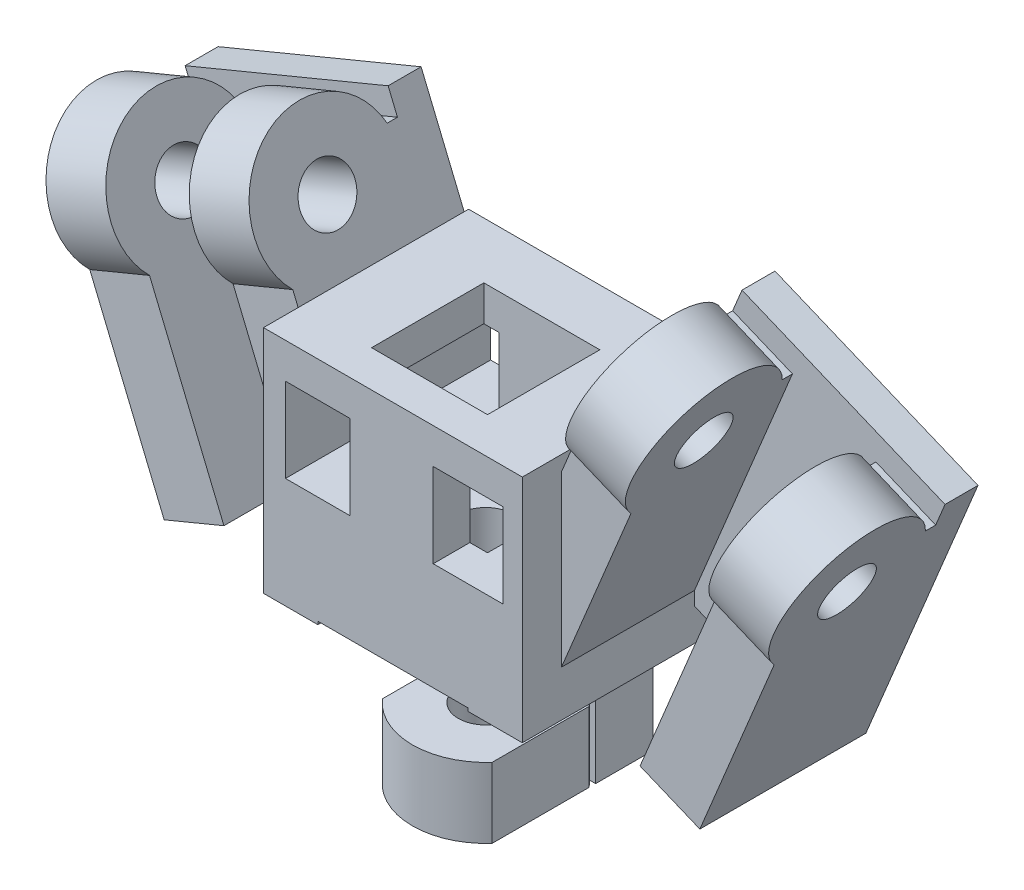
ISO-10303-21;
HEADER;
FILE_DESCRIPTION(('STEP AP214'),'2;1');
FILE_NAME('part.step','',(''),(''),'','','');
FILE_SCHEMA(('AUTOMOTIVE_DESIGN { 1 0 10303 214 1 1 1 1 }'));
ENDSEC;
DATA;
#1=APPLICATION_CONTEXT('core data for automotive mechanical design processes');
#2=APPLICATION_PROTOCOL_DEFINITION('international standard','automotive_design',2000,#1);
#3=PRODUCT_CONTEXT('',#1,'mechanical');
#4=PRODUCT('Part','Part','',(#3));
#5=PRODUCT_RELATED_PRODUCT_CATEGORY('part','',(#4));
#6=PRODUCT_DEFINITION_FORMATION('','',#4);
#7=PRODUCT_DEFINITION_CONTEXT('part definition',#1,'design');
#8=PRODUCT_DEFINITION('design','',#6,#7);
#9=PRODUCT_DEFINITION_SHAPE('','',#8);
#10=(LENGTH_UNIT() NAMED_UNIT(*) SI_UNIT(.MILLI.,.METRE.));
#11=(NAMED_UNIT(*) PLANE_ANGLE_UNIT() SI_UNIT($,.RADIAN.));
#12=(NAMED_UNIT(*) SI_UNIT($,.STERADIAN.) SOLID_ANGLE_UNIT());
#13=UNCERTAINTY_MEASURE_WITH_UNIT(LENGTH_MEASURE(1.E-05),#10,'distance_accuracy_value','');
#14=(GEOMETRIC_REPRESENTATION_CONTEXT(3) GLOBAL_UNCERTAINTY_ASSIGNED_CONTEXT((#13)) GLOBAL_UNIT_ASSIGNED_CONTEXT((#10,
#11,#12)) REPRESENTATION_CONTEXT('',''));
#15=CARTESIAN_POINT('',(0.,0.,0.));
#16=DIRECTION('',(0.,0.,1.));
#17=DIRECTION('',(1.,0.,0.));
#18=AXIS2_PLACEMENT_3D('',#15,#16,#17);
#19=CARTESIAN_POINT('',(-3.5,44.,-97.4));
#20=DIRECTION('',(1.,0.,0.));
#21=DIRECTION('',(0.,0.,-1.));
#22=AXIS2_PLACEMENT_3D('',#19,#20,#21);
#23=PLANE('',#22);
#24=DIRECTION('',(0.,0.,1.));
#25=VECTOR('',#24,1.);
#26=CARTESIAN_POINT('',(-3.5,47.45,-97.4));
#27=LINE('',#26,#25);
#28=CARTESIAN_POINT('',(-3.5,47.45,-83.4));
#29=VERTEX_POINT('',#28);
#30=CARTESIAN_POINT('',(-3.5,47.45,-80.4));
#31=VERTEX_POINT('',#30);
#32=EDGE_CURVE('E698',#29,#31,#27,.T.);
#33=ORIENTED_EDGE('',*,*,#32,.F.);
#34=DIRECTION('',(0.,-1.,0.));
#35=VECTOR('',#34,1.);
#36=CARTESIAN_POINT('',(-3.5,44.,-83.4));
#37=LINE('',#36,#35);
#38=CARTESIAN_POINT('',(-3.5,40.55,-83.4));
#39=VERTEX_POINT('',#38);
#40=EDGE_CURVE('E527',#29,#39,#37,.T.);
#41=ORIENTED_EDGE('',*,*,#40,.T.);
#42=DIRECTION('',(0.,0.,1.));
#43=VECTOR('',#42,1.);
#44=CARTESIAN_POINT('',(-3.5,40.55,-97.4));
#45=LINE('',#44,#43);
#46=CARTESIAN_POINT('',(-3.5,40.55,-80.4));
#47=VERTEX_POINT('',#46);
#48=EDGE_CURVE('E692',#39,#47,#45,.T.);
#49=ORIENTED_EDGE('',*,*,#48,.T.);
#50=DIRECTION('',(0.,1.,0.));
#51=VECTOR('',#50,1.);
#52=CARTESIAN_POINT('',(-3.5,40.925,-80.4));
#53=LINE('',#52,#51);
#54=EDGE_CURVE('E706',#47,#31,#53,.T.);
#55=ORIENTED_EDGE('',*,*,#54,.T.);
#56=EDGE_LOOP('',(#33,#41,#49,#55));
#57=FACE_BOUND('',#56,.T.);
#58=ADVANCED_FACE('F16',(#57),#23,.F.);
#59=CARTESIAN_POINT('',(3.3,44.,-97.4));
#60=DIRECTION('',(-1.,0.,0.));
#61=DIRECTION('',(0.,0.,1.));
#62=AXIS2_PLACEMENT_3D('',#59,#60,#61);
#63=PLANE('',#62);
#64=DIRECTION('',(0.,0.,1.));
#65=VECTOR('',#64,1.);
#66=CARTESIAN_POINT('',(3.3,40.55,-97.4));
#67=LINE('',#66,#65);
#68=CARTESIAN_POINT('',(3.3,40.55,-83.4));
#69=VERTEX_POINT('',#68);
#70=CARTESIAN_POINT('',(3.3,40.55,-80.4));
#71=VERTEX_POINT('',#70);
#72=EDGE_CURVE('E676',#69,#71,#67,.T.);
#73=ORIENTED_EDGE('',*,*,#72,.F.);
#74=DIRECTION('',(0.,1.,0.));
#75=VECTOR('',#74,1.);
#76=CARTESIAN_POINT('',(3.3,44.,-83.4));
#77=LINE('',#76,#75);
#78=CARTESIAN_POINT('',(3.3,47.45,-83.4));
#79=VERTEX_POINT('',#78);
#80=EDGE_CURVE('E521',#69,#79,#77,.T.);
#81=ORIENTED_EDGE('',*,*,#80,.T.);
#82=DIRECTION('',(0.,0.,1.));
#83=VECTOR('',#82,1.);
#84=CARTESIAN_POINT('',(3.3,47.45,-97.4));
#85=LINE('',#84,#83);
#86=CARTESIAN_POINT('',(3.3,47.45,-80.4));
#87=VERTEX_POINT('',#86);
#88=EDGE_CURVE('E673',#79,#87,#85,.T.);
#89=ORIENTED_EDGE('',*,*,#88,.T.);
#90=DIRECTION('',(0.,-1.,0.));
#91=VECTOR('',#90,1.);
#92=CARTESIAN_POINT('',(3.3,40.925,-80.4));
#93=LINE('',#92,#91);
#94=EDGE_CURVE('E686',#87,#71,#93,.T.);
#95=ORIENTED_EDGE('',*,*,#94,.T.);
#96=EDGE_LOOP('',(#73,#81,#89,#95));
#97=FACE_BOUND('',#96,.T.);
#98=ADVANCED_FACE('F1045',(#97),#63,.F.);
#99=CARTESIAN_POINT('',(0.,29.15,-93.35));
#100=DIRECTION('',(0.,0.,1.));
#101=DIRECTION('',(1.,0.,0.));
#102=AXIS2_PLACEMENT_3D('',#99,#100,#101);
#103=PLANE('',#102);
#104=DIRECTION('',(0.,1.,0.));
#105=VECTOR('',#104,1.);
#106=CARTESIAN_POINT('',(1.96659604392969,25.25,-93.35));
#107=LINE('',#106,#105);
#108=CARTESIAN_POINT('',(1.96659604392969,25.5,-93.35));
#109=VERTEX_POINT('',#108);
#110=CARTESIAN_POINT('',(1.96659604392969,31.75,-93.35));
#111=VERTEX_POINT('',#110);
#112=EDGE_CURVE('E564',#109,#111,#107,.T.);
#113=ORIENTED_EDGE('',*,*,#112,.F.);
#114=DIRECTION('',(-1.,0.,0.));
#115=VECTOR('',#114,1.);
#116=CARTESIAN_POINT('',(0.,25.5,-93.35));
#117=LINE('',#116,#115);
#118=CARTESIAN_POINT('',(4.5,25.5,-93.35));
#119=VERTEX_POINT('',#118);
#120=EDGE_CURVE('E617',#119,#109,#117,.T.);
#121=ORIENTED_EDGE('',*,*,#120,.F.);
#122=DIRECTION('',(0.,-1.,0.));
#123=VECTOR('',#122,1.);
#124=CARTESIAN_POINT('',(4.5,29.15,-93.35));
#125=LINE('',#124,#123);
#126=CARTESIAN_POINT('',(4.5,31.75,-93.35));
#127=VERTEX_POINT('',#126);
#128=EDGE_CURVE('E632',#127,#119,#125,.T.);
#129=ORIENTED_EDGE('',*,*,#128,.F.);
#130=DIRECTION('',(1.,0.,0.));
#131=VECTOR('',#130,1.);
#132=CARTESIAN_POINT('',(0.,31.75,-93.35));
#133=LINE('',#132,#131);
#134=EDGE_CURVE('E1011',#111,#127,#133,.T.);
#135=ORIENTED_EDGE('',*,*,#134,.F.);
#136=EDGE_LOOP('',(#113,#121,#129,#135));
#137=FACE_BOUND('',#136,.T.);
#138=ADVANCED_FACE('F1111',(#137),#103,.T.);
#139=CARTESIAN_POINT('',(0.,22.5,-92.5));
#140=DIRECTION('',(0.,0.,1.));
#141=DIRECTION('',(1.,0.,0.));
#142=AXIS2_PLACEMENT_3D('',#139,#140,#141);
#143=PLANE('',#142);
#144=DIRECTION('',(0.,1.,0.));
#145=VECTOR('',#144,1.);
#146=CARTESIAN_POINT('',(3.49857113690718,25.25,-92.5));
#147=LINE('',#146,#145);
#148=CARTESIAN_POINT('',(3.49857113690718,25.25,-92.5));
#149=VERTEX_POINT('',#148);
#150=CARTESIAN_POINT('',(3.49857113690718,25.5,-92.5));
#151=VERTEX_POINT('',#150);
#152=EDGE_CURVE('E563',#149,#151,#147,.T.);
#153=ORIENTED_EDGE('',*,*,#152,.F.);
#154=DIRECTION('',(-1.,0.,0.));
#155=VECTOR('',#154,1.);
#156=CARTESIAN_POINT('',(0.,25.25,-92.5));
#157=LINE('',#156,#155);
#158=CARTESIAN_POINT('',(3.96862696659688,25.25,-92.5));
#159=VERTEX_POINT('',#158);
#160=EDGE_CURVE('E1017',#159,#149,#157,.T.);
#161=ORIENTED_EDGE('',*,*,#160,.F.);
#162=DIRECTION('',(0.,1.,0.));
#163=VECTOR('',#162,1.);
#164=CARTESIAN_POINT('',(3.96862696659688,19.5,-92.5));
#165=LINE('',#164,#163);
#166=CARTESIAN_POINT('',(3.96862696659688,19.5,-92.5));
#167=VERTEX_POINT('',#166);
#168=EDGE_CURVE('E1022',#167,#159,#165,.T.);
#169=ORIENTED_EDGE('',*,*,#168,.F.);
#170=DIRECTION('',(-1.,0.,0.));
#171=VECTOR('',#170,1.);
#172=CARTESIAN_POINT('',(0.,19.5,-92.5));
#173=LINE('',#172,#171);
#174=CARTESIAN_POINT('',(4.5,19.5,-92.5));
#175=VERTEX_POINT('',#174);
#176=EDGE_CURVE('E615',#175,#167,#173,.T.);
#177=ORIENTED_EDGE('',*,*,#176,.F.);
#178=DIRECTION('',(0.,-1.,0.));
#179=VECTOR('',#178,1.);
#180=CARTESIAN_POINT('',(4.5,22.5,-92.5));
#181=LINE('',#180,#179);
#182=CARTESIAN_POINT('',(4.5,25.5,-92.5));
#183=VERTEX_POINT('',#182);
#184=EDGE_CURVE('E603',#183,#175,#181,.T.);
#185=ORIENTED_EDGE('',*,*,#184,.F.);
#186=DIRECTION('',(1.,0.,0.));
#187=VECTOR('',#186,1.);
#188=CARTESIAN_POINT('',(0.,25.5,-92.5));
#189=LINE('',#188,#187);
#190=EDGE_CURVE('E610',#151,#183,#189,.T.);
#191=ORIENTED_EDGE('',*,*,#190,.F.);
#192=EDGE_LOOP('',(#153,#161,#169,#177,#185,#191));
#193=FACE_BOUND('',#192,.T.);
#194=ADVANCED_FACE('F1319',(#193),#143,.T.);
#195=CARTESIAN_POINT('',(0.,25.5,-96.));
#196=DIRECTION('',(0.,1.,0.));
#197=DIRECTION('',(0.,0.,1.));
#198=AXIS2_PLACEMENT_3D('',#195,#196,#197);
#199=PLANE('',#198);
#200=CARTESIAN_POINT('',(0.,25.5,-88.));
#201=DIRECTION('',(0.,1.,0.));
#202=DIRECTION('',(0.,0.,1.));
#203=AXIS2_PLACEMENT_3D('',#200,#201,#202);
#204=CIRCLE('',#203,5.7);
#205=EDGE_CURVE('E558',#151,#109,#204,.T.);
#206=ORIENTED_EDGE('',*,*,#205,.F.);
#207=ORIENTED_EDGE('',*,*,#190,.T.);
#208=DIRECTION('',(0.,0.,1.));
#209=VECTOR('',#208,1.);
#210=CARTESIAN_POINT('',(4.5,25.5,-96.));
#211=LINE('',#210,#209);
#212=EDGE_CURVE('E597',#119,#183,#211,.T.);
#213=ORIENTED_EDGE('',*,*,#212,.F.);
#214=ORIENTED_EDGE('',*,*,#120,.T.);
#215=EDGE_LOOP('',(#206,#207,#213,#214));
#216=FACE_BOUND('',#215,.T.);
#217=ADVANCED_FACE('F1351',(#216),#199,.T.);
#218=CARTESIAN_POINT('',(0.,31.5,-97.2));
#219=DIRECTION('',(0.,-1.,0.));
#220=DIRECTION('',(0.,0.,-1.));
#221=AXIS2_PLACEMENT_3D('',#218,#219,#220);
#222=PLANE('',#221);
#223=DIRECTION('',(0.,0.,-1.));
#224=VECTOR('',#223,1.);
#225=CARTESIAN_POINT('',(-4.5,31.5,-97.2));
#226=LINE('',#225,#224);
#227=CARTESIAN_POINT('',(-4.5,31.5,-93.38));
#228=VERTEX_POINT('',#227);
#229=CARTESIAN_POINT('',(-4.5,31.5,-97.2));
#230=VERTEX_POINT('',#229);
#231=EDGE_CURVE('E650',#228,#230,#226,.T.);
#232=ORIENTED_EDGE('',*,*,#231,.F.);
#233=DIRECTION('',(1.,0.,0.));
#234=VECTOR('',#233,1.);
#235=CARTESIAN_POINT('',(0.,31.5,-93.38));
#236=LINE('',#235,#234);
#237=CARTESIAN_POINT('',(-6.15,31.5,-93.38));
#238=VERTEX_POINT('',#237);
#239=EDGE_CURVE('E999',#238,#228,#236,.T.);
#240=ORIENTED_EDGE('',*,*,#239,.F.);
#241=DIRECTION('',(0.,0.,-1.));
#242=VECTOR('',#241,1.);
#243=CARTESIAN_POINT('',(-6.15,31.5,-97.2));
#244=LINE('',#243,#242);
#245=CARTESIAN_POINT('',(-6.15,31.5,-80.4));
#246=VERTEX_POINT('',#245);
#247=EDGE_CURVE('E1001',#246,#238,#244,.T.);
#248=ORIENTED_EDGE('',*,*,#247,.F.);
#249=DIRECTION('',(-1.,0.,0.));
#250=VECTOR('',#249,1.);
#251=CARTESIAN_POINT('',(0.,31.5,-80.4));
#252=LINE('',#251,#250);
#253=CARTESIAN_POINT('',(-10.6,31.5,-80.4));
#254=VERTEX_POINT('',#253);
#255=EDGE_CURVE('E941',#246,#254,#252,.T.);
#256=ORIENTED_EDGE('',*,*,#255,.T.);
#257=DIRECTION('',(0.,0.,1.));
#258=VECTOR('',#257,1.);
#259=CARTESIAN_POINT('',(-10.6,31.5,-97.2));
#260=LINE('',#259,#258);
#261=CARTESIAN_POINT('',(-10.6,31.5,-97.2));
#262=VERTEX_POINT('',#261);
#263=EDGE_CURVE('E931',#262,#254,#260,.T.);
#264=ORIENTED_EDGE('',*,*,#263,.F.);
#265=DIRECTION('',(1.,0.,0.));
#266=VECTOR('',#265,1.);
#267=CARTESIAN_POINT('',(0.,31.5,-97.2));
#268=LINE('',#267,#266);
#269=EDGE_CURVE('E909',#262,#230,#268,.T.);
#270=ORIENTED_EDGE('',*,*,#269,.T.);
#271=EDGE_LOOP('',(#232,#240,#248,#256,#264,#270));
#272=FACE_BOUND('',#271,.T.);
#273=ADVANCED_FACE('F1137',(#272),#222,.T.);
#274=CARTESIAN_POINT('',(0.,25.55,-93.38));
#275=DIRECTION('',(0.,0.,-1.));
#276=DIRECTION('',(-1.,0.,0.));
#277=AXIS2_PLACEMENT_3D('',#274,#275,#276);
#278=PLANE('',#277);
#279=ORIENTED_EDGE('',*,*,#239,.T.);
#280=DIRECTION('',(0.,1.,0.));
#281=VECTOR('',#280,1.);
#282=CARTESIAN_POINT('',(-4.5,25.55,-93.38));
#283=LINE('',#282,#281);
#284=CARTESIAN_POINT('',(-4.5,31.75,-93.38));
#285=VERTEX_POINT('',#284);
#286=EDGE_CURVE('E1008',#228,#285,#283,.T.);
#287=ORIENTED_EDGE('',*,*,#286,.T.);
#288=DIRECTION('',(-1.,0.,0.));
#289=VECTOR('',#288,1.);
#290=CARTESIAN_POINT('',(0.,31.75,-93.38));
#291=LINE('',#290,#289);
#292=CARTESIAN_POINT('',(-6.15,31.75,-93.38));
#293=VERTEX_POINT('',#292);
#294=EDGE_CURVE('E656',#285,#293,#291,.T.);
#295=ORIENTED_EDGE('',*,*,#294,.T.);
#296=DIRECTION('',(0.,-1.,0.));
#297=VECTOR('',#296,1.);
#298=CARTESIAN_POINT('',(-6.15,25.55,-93.38));
#299=LINE('',#298,#297);
#300=EDGE_CURVE('E647',#293,#238,#299,.T.);
#301=ORIENTED_EDGE('',*,*,#300,.T.);
#302=EDGE_LOOP('',(#279,#287,#295,#301));
#303=FACE_BOUND('',#302,.T.);
#304=ADVANCED_FACE('F1132',(#303),#278,.F.);
#305=CARTESIAN_POINT('',(0.,40.925,-80.4));
#306=DIRECTION('',(0.,0.,1.));
#307=DIRECTION('',(1.,0.,0.));
#308=AXIS2_PLACEMENT_3D('',#305,#306,#307);
#309=PLANE('',#308);
#310=DIRECTION('',(0.,-1.,0.));
#311=VECTOR('',#310,1.);
#312=CARTESIAN_POINT('',(-6.15,40.925,-80.4));
#313=LINE('',#312,#311);
#314=CARTESIAN_POINT('',(-6.15,31.75,-80.4));
#315=VERTEX_POINT('',#314);
#316=EDGE_CURVE('E666',#315,#246,#313,.T.);
#317=ORIENTED_EDGE('',*,*,#316,.F.);
#318=DIRECTION('',(-1.,0.,0.));
#319=VECTOR('',#318,1.);
#320=CARTESIAN_POINT('',(0.,31.75,-80.4));
#321=LINE('',#320,#319);
#322=CARTESIAN_POINT('',(6.15,31.75,-80.4));
#323=VERTEX_POINT('',#322);
#324=EDGE_CURVE('E1003',#323,#315,#321,.T.);
#325=ORIENTED_EDGE('',*,*,#324,.F.);
#326=DIRECTION('',(0.,1.,0.));
#327=VECTOR('',#326,1.);
#328=CARTESIAN_POINT('',(6.15,40.925,-80.4));
#329=LINE('',#328,#327);
#330=CARTESIAN_POINT('',(6.15,31.5,-80.4));
#331=VERTEX_POINT('',#330);
#332=EDGE_CURVE('E661',#331,#323,#329,.T.);
#333=ORIENTED_EDGE('',*,*,#332,.F.);
#334=CARTESIAN_POINT('',(10.6,31.5,-80.4));
#335=VERTEX_POINT('',#334);
#336=EDGE_CURVE('E942',#335,#331,#252,.T.);
#337=ORIENTED_EDGE('',*,*,#336,.F.);
#338=DIRECTION('',(0.,-1.,0.));
#339=VECTOR('',#338,1.);
#340=CARTESIAN_POINT('',(10.6,40.925,-80.4));
#341=LINE('',#340,#339);
#342=CARTESIAN_POINT('',(10.6,50.35,-80.4));
#343=VERTEX_POINT('',#342);
#344=EDGE_CURVE('E933',#343,#335,#341,.T.);
#345=ORIENTED_EDGE('',*,*,#344,.F.);
#346=DIRECTION('',(1.,0.,0.));
#347=VECTOR('',#346,1.);
#348=CARTESIAN_POINT('',(0.,50.35,-80.4));
#349=LINE('',#348,#347);
#350=CARTESIAN_POINT('',(-10.6,50.35,-80.4));
#351=VERTEX_POINT('',#350);
#352=EDGE_CURVE('E940',#351,#343,#349,.T.);
#353=ORIENTED_EDGE('',*,*,#352,.F.);
#354=DIRECTION('',(0.,1.,0.));
#355=VECTOR('',#354,1.);
#356=CARTESIAN_POINT('',(-10.6,40.925,-80.4));
#357=LINE('',#356,#355);
#358=EDGE_CURVE('E936',#254,#351,#357,.T.);
#359=ORIENTED_EDGE('',*,*,#358,.F.);
#360=ORIENTED_EDGE('',*,*,#255,.F.);
#361=EDGE_LOOP('',(#317,#325,#333,#337,#345,#353,#359,#360));
#362=FACE_BOUND('',#361,.T.);
#363=DIRECTION('',(1.,0.,0.));
#364=VECTOR('',#363,1.);
#365=CARTESIAN_POINT('',(0.,40.55,-80.4));
#366=LINE('',#365,#364);
#367=CARTESIAN_POINT('',(9.,40.55,-80.4));
#368=VERTEX_POINT('',#367);
#369=EDGE_CURVE('E687',#71,#368,#366,.T.);
#370=ORIENTED_EDGE('',*,*,#369,.F.);
#371=ORIENTED_EDGE('',*,*,#94,.F.);
#372=DIRECTION('',(-1.,0.,0.));
#373=VECTOR('',#372,1.);
#374=CARTESIAN_POINT('',(0.,47.45,-80.4));
#375=LINE('',#374,#373);
#376=CARTESIAN_POINT('',(9.,47.45,-80.4));
#377=VERTEX_POINT('',#376);
#378=EDGE_CURVE('E682',#377,#87,#375,.T.);
#379=ORIENTED_EDGE('',*,*,#378,.F.);
#380=DIRECTION('',(0.,1.,0.));
#381=VECTOR('',#380,1.);
#382=CARTESIAN_POINT('',(9.,40.925,-80.4));
#383=LINE('',#382,#381);
#384=EDGE_CURVE('E681',#368,#377,#383,.T.);
#385=ORIENTED_EDGE('',*,*,#384,.F.);
#386=EDGE_LOOP('',(#370,#371,#379,#385));
#387=FACE_BOUND('',#386,.T.);
#388=DIRECTION('',(1.,0.,0.));
#389=VECTOR('',#388,1.);
#390=CARTESIAN_POINT('',(0.,40.55,-80.4));
#391=LINE('',#390,#389);
#392=CARTESIAN_POINT('',(-8.8,40.55,-80.4));
#393=VERTEX_POINT('',#392);
#394=EDGE_CURVE('E712',#393,#47,#391,.T.);
#395=ORIENTED_EDGE('',*,*,#394,.F.);
#396=DIRECTION('',(0.,-1.,0.));
#397=VECTOR('',#396,1.);
#398=CARTESIAN_POINT('',(-8.8,40.925,-80.4));
#399=LINE('',#398,#397);
#400=CARTESIAN_POINT('',(-8.8,47.45,-80.4));
#401=VERTEX_POINT('',#400);
#402=EDGE_CURVE('E711',#401,#393,#399,.T.);
#403=ORIENTED_EDGE('',*,*,#402,.F.);
#404=DIRECTION('',(-1.,0.,0.));
#405=VECTOR('',#404,1.);
#406=CARTESIAN_POINT('',(0.,47.45,-80.4));
#407=LINE('',#406,#405);
#408=EDGE_CURVE('E707',#31,#401,#407,.T.);
#409=ORIENTED_EDGE('',*,*,#408,.F.);
#410=ORIENTED_EDGE('',*,*,#54,.F.);
#411=EDGE_LOOP('',(#395,#403,#409,#410));
#412=FACE_BOUND('',#411,.T.);
#413=ADVANCED_FACE('F18',(#362,#387,#412),#309,.T.);
#414=DIRECTION('',(0.,0.,1.));
#415=VECTOR('',#414,1.);
#416=CARTESIAN_POINT('',(4.5,31.5,-97.2));
#417=LINE('',#416,#415);
#418=CARTESIAN_POINT('',(4.5,31.5,-97.2));
#419=VERTEX_POINT('',#418);
#420=CARTESIAN_POINT('',(4.5,31.5,-93.38));
#421=VERTEX_POINT('',#420);
#422=EDGE_CURVE('E645',#419,#421,#417,.T.);
#423=ORIENTED_EDGE('',*,*,#422,.F.);
#424=CARTESIAN_POINT('',(10.6,31.5,-97.2));
#425=VERTEX_POINT('',#424);
#426=EDGE_CURVE('E907',#419,#425,#268,.T.);
#427=ORIENTED_EDGE('',*,*,#426,.T.);
#428=DIRECTION('',(0.,0.,1.));
#429=VECTOR('',#428,1.);
#430=CARTESIAN_POINT('',(10.6,31.5,-97.2));
#431=LINE('',#430,#429);
#432=EDGE_CURVE('E918',#425,#335,#431,.T.);
#433=ORIENTED_EDGE('',*,*,#432,.T.);
#434=ORIENTED_EDGE('',*,*,#336,.T.);
#435=DIRECTION('',(0.,0.,1.));
#436=VECTOR('',#435,1.);
#437=CARTESIAN_POINT('',(6.15,31.5,-97.2));
#438=LINE('',#437,#436);
#439=CARTESIAN_POINT('',(6.15,31.5,-93.38));
#440=VERTEX_POINT('',#439);
#441=EDGE_CURVE('E993',#440,#331,#438,.T.);
#442=ORIENTED_EDGE('',*,*,#441,.F.);
#443=EDGE_CURVE('E997',#421,#440,#236,.T.);
#444=ORIENTED_EDGE('',*,*,#443,.F.);
#445=EDGE_LOOP('',(#423,#427,#433,#434,#442,#444));
#446=FACE_BOUND('',#445,.T.);
#447=ADVANCED_FACE('F1133',(#446),#222,.T.);
#448=CARTESIAN_POINT('',(-10.6,40.925,-97.2));
#449=DIRECTION('',(-1.,0.,0.));
#450=DIRECTION('',(0.,0.,1.));
#451=AXIS2_PLACEMENT_3D('',#448,#449,#450);
#452=PLANE('',#451);
#453=DIRECTION('',(0.,0.,1.));
#454=VECTOR('',#453,1.);
#455=CARTESIAN_POINT('',(-10.6,35.25922970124,-97.2));
#456=LINE('',#455,#454);
#457=CARTESIAN_POINT('',(-10.6,35.25922970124,-94.5));
#458=VERTEX_POINT('',#457);
#459=CARTESIAN_POINT('',(-10.6,35.25922970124,-83.6));
#460=VERTEX_POINT('',#459);
#461=EDGE_CURVE('E747',#458,#460,#456,.T.);
#462=ORIENTED_EDGE('',*,*,#461,.F.);
#463=DIRECTION('',(0.,1.,0.));
#464=VECTOR('',#463,1.);
#465=CARTESIAN_POINT('',(-10.6,40.925,-94.5));
#466=LINE('',#465,#464);
#467=CARTESIAN_POINT('',(-10.6,34.1424985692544,-94.5));
#468=VERTEX_POINT('',#467);
#469=EDGE_CURVE('E965',#468,#458,#466,.T.);
#470=ORIENTED_EDGE('',*,*,#469,.F.);
#471=DIRECTION('',(0.,0.,1.));
#472=VECTOR('',#471,1.);
#473=CARTESIAN_POINT('',(-10.6,34.1424985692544,-97.2));
#474=LINE('',#473,#472);
#475=CARTESIAN_POINT('',(-10.6,34.1424985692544,-97.2));
#476=VERTEX_POINT('',#475);
#477=EDGE_CURVE('E813',#476,#468,#474,.T.);
#478=ORIENTED_EDGE('',*,*,#477,.F.);
#479=DIRECTION('',(0.,-1.,0.));
#480=VECTOR('',#479,1.);
#481=CARTESIAN_POINT('',(-10.6,40.925,-97.2));
#482=LINE('',#481,#480);
#483=EDGE_CURVE('E911',#476,#262,#482,.T.);
#484=ORIENTED_EDGE('',*,*,#483,.T.);
#485=ORIENTED_EDGE('',*,*,#263,.T.);
#486=ORIENTED_EDGE('',*,*,#358,.T.);
#487=DIRECTION('',(0.,0.,1.));
#488=VECTOR('',#487,1.);
#489=CARTESIAN_POINT('',(-10.6,50.35,-97.2));
#490=LINE('',#489,#488);
#491=CARTESIAN_POINT('',(-10.6,50.35,-97.2));
#492=VERTEX_POINT('',#491);
#493=EDGE_CURVE('E928',#492,#351,#490,.T.);
#494=ORIENTED_EDGE('',*,*,#493,.F.);
#495=CARTESIAN_POINT('',(-10.6,49.1087971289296,-97.2));
#496=VERTEX_POINT('',#495);
#497=EDGE_CURVE('E921',#492,#496,#482,.T.);
#498=ORIENTED_EDGE('',*,*,#497,.T.);
#499=DIRECTION('',(0.,0.,-1.));
#500=VECTOR('',#499,1.);
#501=CARTESIAN_POINT('',(-10.6,49.1087971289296,-97.2));
#502=LINE('',#501,#500);
#503=CARTESIAN_POINT('',(-10.6,49.1087971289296,-83.6));
#504=VERTEX_POINT('',#503);
#505=EDGE_CURVE('E807',#504,#496,#502,.T.);
#506=ORIENTED_EDGE('',*,*,#505,.F.);
#507=DIRECTION('',(0.,1.,0.));
#508=VECTOR('',#507,1.);
#509=CARTESIAN_POINT('',(-10.6,40.925,-83.6));
#510=LINE('',#509,#508);
#511=EDGE_CURVE('E970',#460,#504,#510,.T.);
#512=ORIENTED_EDGE('',*,*,#511,.F.);
#513=EDGE_LOOP('',(#462,#470,#478,#484,#485,#486,#494,#498,#506,#512));
#514=FACE_BOUND('',#513,.T.);
#515=ADVANCED_FACE('F1136',(#514),#452,.T.);
#516=CARTESIAN_POINT('',(0.,50.35,-97.2));
#517=DIRECTION('',(0.,1.,0.));
#518=DIRECTION('',(0.,0.,1.));
#519=AXIS2_PLACEMENT_3D('',#516,#517,#518);
#520=PLANE('',#519);
#521=DIRECTION('',(1.,0.,0.));
#522=VECTOR('',#521,1.);
#523=CARTESIAN_POINT('',(0.,50.35,-83.4));
#524=LINE('',#523,#522);
#525=CARTESIAN_POINT('',(-4.75,50.35,-83.4));
#526=VERTEX_POINT('',#525);
#527=CARTESIAN_POINT('',(4.75,50.35,-83.4));
#528=VERTEX_POINT('',#527);
#529=EDGE_CURVE('E536',#526,#528,#524,.T.);
#530=ORIENTED_EDGE('',*,*,#529,.F.);
#531=DIRECTION('',(0.,0.,1.));
#532=VECTOR('',#531,1.);
#533=CARTESIAN_POINT('',(-4.75,50.35,-97.2));
#534=LINE('',#533,#532);
#535=CARTESIAN_POINT('',(-4.75,50.35,-92.6));
#536=VERTEX_POINT('',#535);
#537=EDGE_CURVE('E541',#536,#526,#534,.T.);
#538=ORIENTED_EDGE('',*,*,#537,.F.);
#539=DIRECTION('',(-1.,0.,0.));
#540=VECTOR('',#539,1.);
#541=CARTESIAN_POINT('',(0.,50.35,-92.6));
#542=LINE('',#541,#540);
#543=CARTESIAN_POINT('',(4.75,50.35,-92.6));
#544=VERTEX_POINT('',#543);
#545=EDGE_CURVE('E518',#544,#536,#542,.T.);
#546=ORIENTED_EDGE('',*,*,#545,.F.);
#547=DIRECTION('',(0.,0.,-1.));
#548=VECTOR('',#547,1.);
#549=CARTESIAN_POINT('',(4.75,50.35,-97.2));
#550=LINE('',#549,#548);
#551=EDGE_CURVE('E506',#528,#544,#550,.T.);
#552=ORIENTED_EDGE('',*,*,#551,.F.);
#553=EDGE_LOOP('',(#530,#538,#546,#552));
#554=FACE_BOUND('',#553,.T.);
#555=ORIENTED_EDGE('',*,*,#493,.T.);
#556=ORIENTED_EDGE('',*,*,#352,.T.);
#557=DIRECTION('',(0.,0.,1.));
#558=VECTOR('',#557,1.);
#559=CARTESIAN_POINT('',(10.6,50.35,-97.2));
#560=LINE('',#559,#558);
#561=CARTESIAN_POINT('',(10.6,50.35,-97.2));
#562=VERTEX_POINT('',#561);
#563=EDGE_CURVE('E924',#562,#343,#560,.T.);
#564=ORIENTED_EDGE('',*,*,#563,.F.);
#565=DIRECTION('',(-1.,0.,0.));
#566=VECTOR('',#565,1.);
#567=CARTESIAN_POINT('',(0.,50.35,-97.2));
#568=LINE('',#567,#566);
#569=EDGE_CURVE('E916',#562,#492,#568,.T.);
#570=ORIENTED_EDGE('',*,*,#569,.T.);
#571=EDGE_LOOP('',(#555,#556,#564,#570));
#572=FACE_BOUND('',#571,.T.);
#573=ADVANCED_FACE('F1075',(#554,#572),#520,.T.);
#574=CARTESIAN_POINT('',(0.,40.925,-97.2));
#575=DIRECTION('',(0.,0.,-1.));
#576=DIRECTION('',(-1.,0.,0.));
#577=AXIS2_PLACEMENT_3D('',#574,#575,#576);
#578=PLANE('',#577);
#579=ORIENTED_EDGE('',*,*,#426,.F.);
#580=DIRECTION('',(0.,1.,0.));
#581=VECTOR('',#580,1.);
#582=CARTESIAN_POINT('',(4.5,29.15,-97.2));
#583=LINE('',#582,#581);
#584=CARTESIAN_POINT('',(4.5,19.5,-97.2));
#585=VERTEX_POINT('',#584);
#586=EDGE_CURVE('E626',#585,#419,#583,.T.);
#587=ORIENTED_EDGE('',*,*,#586,.F.);
#588=DIRECTION('',(1.,0.,0.));
#589=VECTOR('',#588,1.);
#590=CARTESIAN_POINT('',(0.,19.5,-97.2));
#591=LINE('',#590,#589);
#592=CARTESIAN_POINT('',(-4.5,19.5,-97.2));
#593=VERTEX_POINT('',#592);
#594=EDGE_CURVE('E621',#593,#585,#591,.T.);
#595=ORIENTED_EDGE('',*,*,#594,.F.);
#596=DIRECTION('',(0.,-1.,0.));
#597=VECTOR('',#596,1.);
#598=CARTESIAN_POINT('',(-4.5,29.15,-97.2));
#599=LINE('',#598,#597);
#600=EDGE_CURVE('E624',#230,#593,#599,.T.);
#601=ORIENTED_EDGE('',*,*,#600,.F.);
#602=ORIENTED_EDGE('',*,*,#269,.F.);
#603=ORIENTED_EDGE('',*,*,#483,.F.);
#604=DIRECTION('',(0.923879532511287,0.38268343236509,0.));
#605=VECTOR('',#604,1.);
#606=CARTESIAN_POINT('',(-13.6235301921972,32.8901113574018,-97.2));
#607=LINE('',#606,#605);
#608=CARTESIAN_POINT('',(-21.9384459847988,29.445960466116,-97.2));
#609=VERTEX_POINT('',#608);
#610=EDGE_CURVE('E783',#609,#476,#607,.T.);
#611=ORIENTED_EDGE('',*,*,#610,.F.);
#612=DIRECTION('',(0.38268343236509,-0.923879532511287,0.));
#613=VECTOR('',#612,1.);
#614=CARTESIAN_POINT('',(-26.5306471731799,40.5325148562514,-97.2));
#615=LINE('',#614,#613);
#616=CARTESIAN_POINT('',(-31.1228483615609,51.6190692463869,-97.2));
#617=VERTEX_POINT('',#616);
#618=EDGE_CURVE('E784',#617,#609,#615,.T.);
#619=ORIENTED_EDGE('',*,*,#618,.F.);
#620=DIRECTION('',(-0.923879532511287,-0.38268343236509,0.));
#621=VECTOR('',#620,1.);
#622=CARTESIAN_POINT('',(-22.8079325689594,55.0632201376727,-97.2));
#623=LINE('',#622,#621);
#624=CARTESIAN_POINT('',(-14.4930167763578,58.5073710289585,-97.2));
#625=VERTEX_POINT('',#624);
#626=EDGE_CURVE('E787',#625,#617,#623,.T.);
#627=ORIENTED_EDGE('',*,*,#626,.F.);
#628=DIRECTION('',(-0.38268343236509,0.923879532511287,0.));
#629=VECTOR('',#628,1.);
#630=CARTESIAN_POINT('',(-9.90081558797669,47.4208166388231,-97.2));
#631=LINE('',#630,#629);
#632=EDGE_CURVE('E790',#496,#625,#631,.T.);
#633=ORIENTED_EDGE('',*,*,#632,.F.);
#634=ORIENTED_EDGE('',*,*,#497,.F.);
#635=ORIENTED_EDGE('',*,*,#569,.F.);
#636=DIRECTION('',(0.,1.,0.));
#637=VECTOR('',#636,1.);
#638=CARTESIAN_POINT('',(10.6,40.925,-97.2));
#639=LINE('',#638,#637);
#640=CARTESIAN_POINT('',(10.6,49.1087971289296,-97.2));
#641=VERTEX_POINT('',#640);
#642=EDGE_CURVE('E920',#641,#562,#639,.T.);
#643=ORIENTED_EDGE('',*,*,#642,.F.);
#644=DIRECTION('',(-0.38268343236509,-0.923879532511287,0.));
#645=VECTOR('',#644,1.);
#646=CARTESIAN_POINT('',(9.90081558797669,47.4208166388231,-97.2));
#647=LINE('',#646,#645);
#648=CARTESIAN_POINT('',(14.4930167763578,58.5073710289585,-97.2));
#649=VERTEX_POINT('',#648);
#650=EDGE_CURVE('E881',#649,#641,#647,.T.);
#651=ORIENTED_EDGE('',*,*,#650,.F.);
#652=DIRECTION('',(-0.923879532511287,0.38268343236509,0.));
#653=VECTOR('',#652,1.);
#654=CARTESIAN_POINT('',(22.8079325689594,55.0632201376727,-97.2));
#655=LINE('',#654,#653);
#656=CARTESIAN_POINT('',(31.1228483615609,51.6190692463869,-97.2));
#657=VERTEX_POINT('',#656);
#658=EDGE_CURVE('E889',#657,#649,#655,.T.);
#659=ORIENTED_EDGE('',*,*,#658,.F.);
#660=DIRECTION('',(0.38268343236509,0.923879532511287,0.));
#661=VECTOR('',#660,1.);
#662=CARTESIAN_POINT('',(26.5306471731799,40.5325148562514,-97.2));
#663=LINE('',#662,#661);
#664=CARTESIAN_POINT('',(21.9384459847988,29.445960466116,-97.2));
#665=VERTEX_POINT('',#664);
#666=EDGE_CURVE('E883',#665,#657,#663,.T.);
#667=ORIENTED_EDGE('',*,*,#666,.F.);
#668=DIRECTION('',(0.923879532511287,-0.38268343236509,0.));
#669=VECTOR('',#668,1.);
#670=CARTESIAN_POINT('',(13.6235301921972,32.8901113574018,-97.2));
#671=LINE('',#670,#669);
#672=CARTESIAN_POINT('',(10.6,34.1424985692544,-97.2));
#673=VERTEX_POINT('',#672);
#674=EDGE_CURVE('E885',#673,#665,#671,.T.);
#675=ORIENTED_EDGE('',*,*,#674,.F.);
#676=EDGE_CURVE('E915',#425,#673,#639,.T.);
#677=ORIENTED_EDGE('',*,*,#676,.F.);
#678=EDGE_LOOP('',(#579,#587,#595,#601,#602,#603,#611,#619,#627,#633,#634,#635,#643,#651,#659,
#667,#675,#677));
#679=FACE_BOUND('',#678,.T.);
#680=DIRECTION('',(-1.,0.,0.));
#681=VECTOR('',#680,1.);
#682=CARTESIAN_POINT('',(0.,40.55,-97.2));
#683=LINE('',#682,#681);
#684=CARTESIAN_POINT('',(9.,40.55,-97.2));
#685=VERTEX_POINT('',#684);
#686=CARTESIAN_POINT('',(3.3,40.55,-97.2));
#687=VERTEX_POINT('',#686);
#688=EDGE_CURVE('E994',#685,#687,#683,.T.);
#689=ORIENTED_EDGE('',*,*,#688,.F.);
#690=DIRECTION('',(0.,-1.,0.));
#691=VECTOR('',#690,1.);
#692=CARTESIAN_POINT('',(9.,40.925,-97.2));
#693=LINE('',#692,#691);
#694=CARTESIAN_POINT('',(9.,47.45,-97.2));
#695=VERTEX_POINT('',#694);
#696=EDGE_CURVE('E986',#695,#685,#693,.T.);
#697=ORIENTED_EDGE('',*,*,#696,.F.);
#698=DIRECTION('',(1.,0.,0.));
#699=VECTOR('',#698,1.);
#700=CARTESIAN_POINT('',(0.,47.45,-97.2));
#701=LINE('',#700,#699);
#702=CARTESIAN_POINT('',(3.3,47.45,-97.2));
#703=VERTEX_POINT('',#702);
#704=EDGE_CURVE('E987',#703,#695,#701,.T.);
#705=ORIENTED_EDGE('',*,*,#704,.F.);
#706=DIRECTION('',(0.,1.,0.));
#707=VECTOR('',#706,1.);
#708=CARTESIAN_POINT('',(3.3,40.925,-97.2));
#709=LINE('',#708,#707);
#710=EDGE_CURVE('E992',#687,#703,#709,.T.);
#711=ORIENTED_EDGE('',*,*,#710,.F.);
#712=EDGE_LOOP('',(#689,#697,#705,#711));
#713=FACE_BOUND('',#712,.T.);
#714=DIRECTION('',(-1.,0.,0.));
#715=VECTOR('',#714,1.);
#716=CARTESIAN_POINT('',(0.,40.55,-97.2));
#717=LINE('',#716,#715);
#718=CARTESIAN_POINT('',(-3.5,40.55,-97.2));
#719=VERTEX_POINT('',#718);
#720=CARTESIAN_POINT('',(-8.8,40.55,-97.2));
#721=VERTEX_POINT('',#720);
#722=EDGE_CURVE('E982',#719,#721,#717,.T.);
#723=ORIENTED_EDGE('',*,*,#722,.F.);
#724=DIRECTION('',(0.,-1.,0.));
#725=VECTOR('',#724,1.);
#726=CARTESIAN_POINT('',(-3.5,40.925,-97.2));
#727=LINE('',#726,#725);
#728=CARTESIAN_POINT('',(-3.5,47.45,-97.2));
#729=VERTEX_POINT('',#728);
#730=EDGE_CURVE('E972',#729,#719,#727,.T.);
#731=ORIENTED_EDGE('',*,*,#730,.F.);
#732=DIRECTION('',(1.,0.,0.));
#733=VECTOR('',#732,1.);
#734=CARTESIAN_POINT('',(0.,47.45,-97.2));
#735=LINE('',#734,#733);
#736=CARTESIAN_POINT('',(-8.8,47.45,-97.2));
#737=VERTEX_POINT('',#736);
#738=EDGE_CURVE('E977',#737,#729,#735,.T.);
#739=ORIENTED_EDGE('',*,*,#738,.F.);
#740=DIRECTION('',(0.,1.,0.));
#741=VECTOR('',#740,1.);
#742=CARTESIAN_POINT('',(-8.8,40.925,-97.2));
#743=LINE('',#742,#741);
#744=EDGE_CURVE('E985',#721,#737,#743,.T.);
#745=ORIENTED_EDGE('',*,*,#744,.F.);
#746=EDGE_LOOP('',(#723,#731,#739,#745));
#747=FACE_BOUND('',#746,.T.);
#748=ADVANCED_FACE('F1082',(#679,#713,#747),#578,.T.);
#749=CARTESIAN_POINT('',(10.6,40.925,-97.2));
#750=DIRECTION('',(1.,0.,0.));
#751=DIRECTION('',(0.,0.,-1.));
#752=AXIS2_PLACEMENT_3D('',#749,#750,#751);
#753=PLANE('',#752);
#754=DIRECTION('',(0.,-1.,0.));
#755=VECTOR('',#754,1.);
#756=CARTESIAN_POINT('',(10.6,40.925,-83.6));
#757=LINE('',#756,#755);
#758=CARTESIAN_POINT('',(10.6,49.1087971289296,-83.6));
#759=VERTEX_POINT('',#758);
#760=CARTESIAN_POINT('',(10.6,35.25922970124,-83.6));
#761=VERTEX_POINT('',#760);
#762=EDGE_CURVE('E956',#759,#761,#757,.T.);
#763=ORIENTED_EDGE('',*,*,#762,.F.);
#764=DIRECTION('',(0.,0.,1.));
#765=VECTOR('',#764,1.);
#766=CARTESIAN_POINT('',(10.6,49.1087971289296,-97.2));
#767=LINE('',#766,#765);
#768=EDGE_CURVE('E945',#641,#759,#767,.T.);
#769=ORIENTED_EDGE('',*,*,#768,.F.);
#770=ORIENTED_EDGE('',*,*,#642,.T.);
#771=ORIENTED_EDGE('',*,*,#563,.T.);
#772=ORIENTED_EDGE('',*,*,#344,.T.);
#773=ORIENTED_EDGE('',*,*,#432,.F.);
#774=ORIENTED_EDGE('',*,*,#676,.T.);
#775=DIRECTION('',(0.,0.,-1.));
#776=VECTOR('',#775,1.);
#777=CARTESIAN_POINT('',(10.6,34.1424985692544,-97.2));
#778=LINE('',#777,#776);
#779=CARTESIAN_POINT('',(10.6,34.1424985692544,-94.5));
#780=VERTEX_POINT('',#779);
#781=EDGE_CURVE('E949',#780,#673,#778,.T.);
#782=ORIENTED_EDGE('',*,*,#781,.F.);
#783=DIRECTION('',(0.,-1.,0.));
#784=VECTOR('',#783,1.);
#785=CARTESIAN_POINT('',(10.6,40.925,-94.5));
#786=LINE('',#785,#784);
#787=CARTESIAN_POINT('',(10.6,35.25922970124,-94.5));
#788=VERTEX_POINT('',#787);
#789=EDGE_CURVE('E950',#788,#780,#786,.T.);
#790=ORIENTED_EDGE('',*,*,#789,.F.);
#791=DIRECTION('',(0.,0.,-1.));
#792=VECTOR('',#791,1.);
#793=CARTESIAN_POINT('',(10.6,35.25922970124,-97.2));
#794=LINE('',#793,#792);
#795=EDGE_CURVE('E878',#761,#788,#794,.T.);
#796=ORIENTED_EDGE('',*,*,#795,.F.);
#797=EDGE_LOOP('',(#763,#769,#770,#771,#772,#773,#774,#782,#790,#796));
#798=FACE_BOUND('',#797,.T.);
#799=ADVANCED_FACE('F1171',(#798),#753,.T.);
#800=CARTESIAN_POINT('',(18.2157313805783,43.9766657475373,-94.5));
#801=DIRECTION('',(0.,0.,1.));
#802=DIRECTION('',(0.923879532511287,-0.38268343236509,0.));
#803=AXIS2_PLACEMENT_3D('',#800,#801,#802);
#804=PLANE('',#803);
#805=DIRECTION('',(-0.38268343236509,-0.923879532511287,0.));
#806=VECTOR('',#805,1.);
#807=CARTESIAN_POINT('',(21.63408565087,42.5607370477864,-94.5));
#808=LINE('',#807,#806);
#809=CARTESIAN_POINT('',(25.4609199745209,51.7995323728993,-94.5));
#810=VERTEX_POINT('',#809);
#811=CARTESIAN_POINT('',(17.041884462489,31.474182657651,-94.5));
#812=VERTEX_POINT('',#811);
#813=EDGE_CURVE('E855',#810,#812,#808,.T.);
#814=ORIENTED_EDGE('',*,*,#813,.F.);
#815=DIRECTION('',(-0.923879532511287,0.38268343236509,0.));
#816=VECTOR('',#815,1.);
#817=CARTESIAN_POINT('',(22.0425657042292,53.2154610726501,-94.5));
#818=LINE('',#817,#816);
#819=CARTESIAN_POINT('',(30.3574814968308,49.7713101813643,-94.5));
#820=VERTEX_POINT('',#819);
#821=EDGE_CURVE('E849',#820,#810,#818,.T.);
#822=ORIENTED_EDGE('',*,*,#821,.F.);
#823=DIRECTION('',(-0.38268343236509,-0.923879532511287,0.));
#824=VECTOR('',#823,1.);
#825=CARTESIAN_POINT('',(26.5306471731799,40.5325148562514,-94.5));
#826=LINE('',#825,#824);
#827=CARTESIAN_POINT('',(31.1228483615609,51.6190692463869,-94.5));
#828=VERTEX_POINT('',#827);
#829=EDGE_CURVE('E899',#828,#820,#826,.T.);
#830=ORIENTED_EDGE('',*,*,#829,.F.);
#831=DIRECTION('',(0.923879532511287,-0.38268343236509,0.));
#832=VECTOR('',#831,1.);
#833=CARTESIAN_POINT('',(22.8079325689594,55.0632201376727,-94.5));
#834=LINE('',#833,#832);
#835=CARTESIAN_POINT('',(14.4930167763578,58.5073710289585,-94.5));
#836=VERTEX_POINT('',#835);
#837=EDGE_CURVE('E902',#836,#828,#834,.T.);
#838=ORIENTED_EDGE('',*,*,#837,.F.);
#839=DIRECTION('',(0.38268343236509,0.923879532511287,0.));
#840=VECTOR('',#839,1.);
#841=CARTESIAN_POINT('',(9.90081558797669,47.4208166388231,-94.5));
#842=LINE('',#841,#840);
#843=CARTESIAN_POINT('',(13.7276499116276,56.6596119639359,-94.5));
#844=VERTEX_POINT('',#843);
#845=EDGE_CURVE('E904',#844,#836,#842,.T.);
#846=ORIENTED_EDGE('',*,*,#845,.F.);
#847=DIRECTION('',(-0.923879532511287,0.38268343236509,0.));
#848=VECTOR('',#847,1.);
#849=CARTESIAN_POINT('',(22.0425657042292,53.2154610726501,-94.5));
#850=LINE('',#849,#848);
#851=CARTESIAN_POINT('',(18.6242114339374,54.6313897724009,-94.5));
#852=VERTEX_POINT('',#851);
#853=EDGE_CURVE('E876',#852,#844,#850,.T.);
#854=ORIENTED_EDGE('',*,*,#853,.F.);
#855=DIRECTION('',(0.38268343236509,0.923879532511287,0.));
#856=VECTOR('',#855,1.);
#857=CARTESIAN_POINT('',(14.7973771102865,45.3925944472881,-94.5));
#858=LINE('',#857,#856);
#859=EDGE_CURVE('E953',#788,#852,#858,.T.);
#860=ORIENTED_EDGE('',*,*,#859,.F.);
#861=ORIENTED_EDGE('',*,*,#789,.T.);
#862=DIRECTION('',(-0.923879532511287,0.38268343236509,0.));
#863=VECTOR('',#862,1.);
#864=CARTESIAN_POINT('',(13.6235301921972,32.8901113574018,-94.5));
#865=LINE('',#864,#863);
#866=EDGE_CURVE('E910',#812,#780,#865,.T.);
#867=ORIENTED_EDGE('',*,*,#866,.F.);
#868=EDGE_LOOP('',(#814,#822,#830,#838,#846,#854,#860,#861,#867));
#869=FACE_BOUND('',#868,.T.);
#870=ADVANCED_FACE('F1199',(#869),#804,.T.);
#871=CARTESIAN_POINT('',(13.6235301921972,32.8901113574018,-97.2));
#872=DIRECTION('',(-0.38268343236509,-0.923879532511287,0.));
#873=DIRECTION('',(0.,0.,-1.));
#874=AXIS2_PLACEMENT_3D('',#871,#872,#873);
#875=PLANE('',#874);
#876=ORIENTED_EDGE('',*,*,#674,.T.);
#877=DIRECTION('',(0.,0.,1.));
#878=VECTOR('',#877,1.);
#879=CARTESIAN_POINT('',(21.9384459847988,29.445960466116,-97.2));
#880=LINE('',#879,#878);
#881=CARTESIAN_POINT('',(21.9384459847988,29.445960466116,-83.6));
#882=VERTEX_POINT('',#881);
#883=EDGE_CURVE('E887',#665,#882,#880,.T.);
#884=ORIENTED_EDGE('',*,*,#883,.T.);
#885=DIRECTION('',(-0.923879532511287,0.38268343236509,0.));
#886=VECTOR('',#885,1.);
#887=CARTESIAN_POINT('',(19.4901652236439,30.4600715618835,-83.6));
#888=LINE('',#887,#886);
#889=CARTESIAN_POINT('',(17.041884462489,31.474182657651,-83.6));
#890=VERTEX_POINT('',#889);
#891=EDGE_CURVE('E850',#882,#890,#888,.T.);
#892=ORIENTED_EDGE('',*,*,#891,.T.);
#893=DIRECTION('',(0.,0.,1.));
#894=VECTOR('',#893,1.);
#895=CARTESIAN_POINT('',(17.041884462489,31.474182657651,-97.2));
#896=LINE('',#895,#894);
#897=EDGE_CURVE('E839',#812,#890,#896,.T.);
#898=ORIENTED_EDGE('',*,*,#897,.F.);
#899=ORIENTED_EDGE('',*,*,#866,.T.);
#900=ORIENTED_EDGE('',*,*,#781,.T.);
#901=EDGE_LOOP('',(#876,#884,#892,#898,#899,#900));
#902=FACE_BOUND('',#901,.T.);
#903=ADVANCED_FACE('F1181',(#902),#875,.T.);
#904=CARTESIAN_POINT('',(9.90081558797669,47.4208166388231,-97.2));
#905=DIRECTION('',(-0.923879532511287,0.38268343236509,0.));
#906=DIRECTION('',(0.,0.,1.));
#907=AXIS2_PLACEMENT_3D('',#904,#905,#906);
#908=PLANE('',#907);
#909=CARTESIAN_POINT('',(12.9622830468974,54.8118528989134,-88.));
#910=DIRECTION('',(-0.923879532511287,0.38268343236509,0.));
#911=DIRECTION('',(-0.38268343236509,-0.923879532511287,0.));
#912=AXIS2_PLACEMENT_3D('',#909,#910,#911);
#913=CIRCLE('',#912,2.25);
#914=CARTESIAN_POINT('',(12.101245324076,52.733123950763,-88.));
#915=VERTEX_POINT('',#914);
#916=EDGE_CURVE('E822',#915,#915,#913,.T.);
#917=ORIENTED_EDGE('',*,*,#916,.F.);
#918=EDGE_LOOP('',(#917));
#919=FACE_BOUND('',#918,.T.);
#920=DIRECTION('',(0.38268343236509,0.923879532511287,0.));
#921=VECTOR('',#920,1.);
#922=CARTESIAN_POINT('',(9.5181321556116,46.4969371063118,-83.6));
#923=LINE('',#922,#921);
#924=CARTESIAN_POINT('',(11.4012348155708,51.0431490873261,-83.6));
#925=VERTEX_POINT('',#924);
#926=EDGE_CURVE('E873',#759,#925,#923,.T.);
#927=ORIENTED_EDGE('',*,*,#926,.T.);
#928=CARTESIAN_POINT('',(12.9622830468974,54.8118528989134,-88.));
#929=DIRECTION('',(0.923879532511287,-0.38268343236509,0.));
#930=DIRECTION('',(0.,0.,-1.));
#931=AXIS2_PLACEMENT_3D('',#928,#929,#930);
#932=CIRCLE('',#931,6.);
#933=CARTESIAN_POINT('',(13.7276499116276,56.6596119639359,-93.6568542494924));
#934=VERTEX_POINT('',#933);
#935=EDGE_CURVE('E852',#934,#925,#932,.T.);
#936=ORIENTED_EDGE('',*,*,#935,.F.);
#937=DIRECTION('',(0.,0.,1.));
#938=VECTOR('',#937,1.);
#939=CARTESIAN_POINT('',(13.7276499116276,56.6596119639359,-97.2));
#940=LINE('',#939,#938);
#941=EDGE_CURVE('E867',#844,#934,#940,.T.);
#942=ORIENTED_EDGE('',*,*,#941,.F.);
#943=ORIENTED_EDGE('',*,*,#845,.T.);
#944=DIRECTION('',(0.,0.,1.));
#945=VECTOR('',#944,1.);
#946=CARTESIAN_POINT('',(14.4930167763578,58.5073710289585,-97.2));
#947=LINE('',#946,#945);
#948=EDGE_CURVE('E896',#649,#836,#947,.T.);
#949=ORIENTED_EDGE('',*,*,#948,.F.);
#950=ORIENTED_EDGE('',*,*,#650,.T.);
#951=ORIENTED_EDGE('',*,*,#768,.T.);
#952=EDGE_LOOP('',(#927,#936,#942,#943,#949,#950,#951));
#953=FACE_BOUND('',#952,.T.);
#954=ADVANCED_FACE('F1216',(#919,#953),#908,.T.);
#955=CARTESIAN_POINT('',(22.8079325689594,55.0632201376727,-97.2));
#956=DIRECTION('',(0.38268343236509,0.923879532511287,0.));
#957=DIRECTION('',(0.,0.,1.));
#958=AXIS2_PLACEMENT_3D('',#955,#956,#957);
#959=PLANE('',#958);
#960=ORIENTED_EDGE('',*,*,#948,.T.);
#961=ORIENTED_EDGE('',*,*,#837,.T.);
#962=DIRECTION('',(0.,0.,1.));
#963=VECTOR('',#962,1.);
#964=CARTESIAN_POINT('',(31.1228483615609,51.6190692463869,-97.2));
#965=LINE('',#964,#963);
#966=EDGE_CURVE('E892',#657,#828,#965,.T.);
#967=ORIENTED_EDGE('',*,*,#966,.F.);
#968=ORIENTED_EDGE('',*,*,#658,.T.);
#969=EDGE_LOOP('',(#960,#961,#967,#968));
#970=FACE_BOUND('',#969,.T.);
#971=ADVANCED_FACE('F1781',(#970),#959,.T.);
#972=CARTESIAN_POINT('',(26.5306471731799,40.5325148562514,-97.2));
#973=DIRECTION('',(0.923879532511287,-0.38268343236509,0.));
#974=DIRECTION('',(0.,0.,-1.));
#975=AXIS2_PLACEMENT_3D('',#972,#973,#974);
#976=PLANE('',#975);
#977=CARTESIAN_POINT('',(29.5921146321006,47.9235511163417,-88.));
#978=DIRECTION('',(0.923879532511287,-0.38268343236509,0.));
#979=DIRECTION('',(0.38268343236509,0.923879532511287,0.));
#980=AXIS2_PLACEMENT_3D('',#977,#978,#979);
#981=CIRCLE('',#980,2.25);
#982=CARTESIAN_POINT('',(30.453152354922,50.0022800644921,-88.));
#983=VERTEX_POINT('',#982);
#984=EDGE_CURVE('E819',#983,#983,#981,.T.);
#985=ORIENTED_EDGE('',*,*,#984,.F.);
#986=EDGE_LOOP('',(#985));
#987=FACE_BOUND('',#986,.T.);
#988=DIRECTION('',(0.,0.,1.));
#989=VECTOR('',#988,1.);
#990=CARTESIAN_POINT('',(30.3574814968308,49.7713101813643,-97.2));
#991=LINE('',#990,#989);
#992=CARTESIAN_POINT('',(30.3574814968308,49.7713101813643,-93.6568542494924));
#993=VERTEX_POINT('',#992);
#994=EDGE_CURVE('E835',#820,#993,#991,.T.);
#995=ORIENTED_EDGE('',*,*,#994,.T.);
#996=CARTESIAN_POINT('',(29.5921146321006,47.9235511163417,-88.));
#997=DIRECTION('',(-0.923879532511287,0.38268343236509,0.));
#998=DIRECTION('',(0.,0.,1.));
#999=AXIS2_PLACEMENT_3D('',#996,#997,#998);
#1000=CIRCLE('',#999,6.);
#1001=CARTESIAN_POINT('',(28.031066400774,44.1548473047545,-83.6));
#1002=VERTEX_POINT('',#1001);
#1003=EDGE_CURVE('E826',#1002,#993,#1000,.T.);
#1004=ORIENTED_EDGE('',*,*,#1003,.F.);
#1005=DIRECTION('',(-0.38268343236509,-0.923879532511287,0.));
#1006=VECTOR('',#1005,1.);
#1007=CARTESIAN_POINT('',(26.1479637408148,39.6086353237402,-83.6));
#1008=LINE('',#1007,#1006);
#1009=EDGE_CURVE('E841',#1002,#882,#1008,.T.);
#1010=ORIENTED_EDGE('',*,*,#1009,.T.);
#1011=ORIENTED_EDGE('',*,*,#883,.F.);
#1012=ORIENTED_EDGE('',*,*,#666,.T.);
#1013=ORIENTED_EDGE('',*,*,#966,.T.);
#1014=ORIENTED_EDGE('',*,*,#829,.T.);
#1015=EDGE_LOOP('',(#995,#1004,#1010,#1011,#1012,#1013,#1014));
#1016=FACE_BOUND('',#1015,.T.);
#1017=ADVANCED_FACE('F1182',(#987,#1016),#976,.T.);
#1018=CARTESIAN_POINT('',(11.9664129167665,45.4828260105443,-83.6));
#1019=DIRECTION('',(0.,0.,1.));
#1020=DIRECTION('',(0.923879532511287,-0.38268343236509,0.));
#1021=AXIS2_PLACEMENT_3D('',#1018,#1019,#1020);
#1022=PLANE('',#1021);
#1023=DIRECTION('',(0.923879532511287,-0.38268343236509,0.));
#1024=VECTOR('',#1023,1.);
#1025=CARTESIAN_POINT('',(11.4012348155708,51.0431490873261,-83.6));
#1026=LINE('',#1025,#1024);
#1027=CARTESIAN_POINT('',(16.2977963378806,49.0149268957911,-83.6));
#1028=VERTEX_POINT('',#1027);
#1029=EDGE_CURVE('E861',#925,#1028,#1026,.T.);
#1030=ORIENTED_EDGE('',*,*,#1029,.F.);
#1031=ORIENTED_EDGE('',*,*,#926,.F.);
#1032=ORIENTED_EDGE('',*,*,#762,.T.);
#1033=DIRECTION('',(-0.38268343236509,-0.923879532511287,0.));
#1034=VECTOR('',#1033,1.);
#1035=CARTESIAN_POINT('',(14.4146936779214,44.4687149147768,-83.6));
#1036=LINE('',#1035,#1034);
#1037=EDGE_CURVE('E871',#1028,#761,#1036,.T.);
#1038=ORIENTED_EDGE('',*,*,#1037,.F.);
#1039=EDGE_LOOP('',(#1030,#1031,#1032,#1038));
#1040=FACE_BOUND('',#1039,.T.);
#1041=ADVANCED_FACE('F1208',(#1040),#1022,.T.);
#1042=CARTESIAN_POINT('',(16.1759306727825,55.6455008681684,-97.2));
#1043=DIRECTION('',(0.38268343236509,0.923879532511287,0.));
#1044=DIRECTION('',(0.,0.,1.));
#1045=AXIS2_PLACEMENT_3D('',#1042,#1043,#1044);
#1046=PLANE('',#1045);
#1047=DIRECTION('',(0.923879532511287,-0.38268343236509,0.));
#1048=VECTOR('',#1047,1.);
#1049=CARTESIAN_POINT('',(13.7276499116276,56.6596119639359,-93.6568542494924));
#1050=LINE('',#1049,#1048);
#1051=CARTESIAN_POINT('',(18.6242114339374,54.6313897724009,-93.6568542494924));
#1052=VERTEX_POINT('',#1051);
#1053=EDGE_CURVE('E859',#1052,#934,#1050,.F.);
#1054=ORIENTED_EDGE('',*,*,#1053,.F.);
#1055=DIRECTION('',(0.,0.,1.));
#1056=VECTOR('',#1055,1.);
#1057=CARTESIAN_POINT('',(18.6242114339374,54.6313897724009,-97.2));
#1058=LINE('',#1057,#1056);
#1059=EDGE_CURVE('E866',#852,#1052,#1058,.T.);
#1060=ORIENTED_EDGE('',*,*,#1059,.F.);
#1061=ORIENTED_EDGE('',*,*,#853,.T.);
#1062=ORIENTED_EDGE('',*,*,#941,.T.);
#1063=EDGE_LOOP('',(#1054,#1060,#1061,#1062));
#1064=FACE_BOUND('',#1063,.T.);
#1065=ADVANCED_FACE('F1760',(#1064),#1046,.T.);
#1066=CARTESIAN_POINT('',(14.4146936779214,44.4687149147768,-97.2));
#1067=DIRECTION('',(0.923879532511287,-0.38268343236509,0.));
#1068=DIRECTION('',(0.,0.,-1.));
#1069=AXIS2_PLACEMENT_3D('',#1066,#1067,#1068);
#1070=PLANE('',#1069);
#1071=CARTESIAN_POINT('',(17.8588445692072,52.7836307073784,-88.));
#1072=DIRECTION('',(0.923879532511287,-0.38268343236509,0.));
#1073=DIRECTION('',(0.38268343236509,0.923879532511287,0.));
#1074=AXIS2_PLACEMENT_3D('',#1071,#1072,#1073);
#1075=CIRCLE('',#1074,2.25);
#1076=CARTESIAN_POINT('',(18.7198822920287,54.8623596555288,-88.));
#1077=VERTEX_POINT('',#1076);
#1078=EDGE_CURVE('E820',#1077,#1077,#1075,.T.);
#1079=ORIENTED_EDGE('',*,*,#1078,.F.);
#1080=EDGE_LOOP('',(#1079));
#1081=FACE_BOUND('',#1080,.T.);
#1082=CARTESIAN_POINT('',(17.8588445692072,52.7836307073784,-88.));
#1083=DIRECTION('',(-0.923879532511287,0.38268343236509,0.));
#1084=DIRECTION('',(0.,0.,1.));
#1085=AXIS2_PLACEMENT_3D('',#1082,#1083,#1084);
#1086=CIRCLE('',#1085,6.);
#1087=EDGE_CURVE('E857',#1028,#1052,#1086,.T.);
#1088=ORIENTED_EDGE('',*,*,#1087,.F.);
#1089=ORIENTED_EDGE('',*,*,#1037,.T.);
#1090=ORIENTED_EDGE('',*,*,#795,.T.);
#1091=ORIENTED_EDGE('',*,*,#859,.T.);
#1092=ORIENTED_EDGE('',*,*,#1059,.T.);
#1093=EDGE_LOOP('',(#1088,#1089,#1090,#1091,#1092));
#1094=FACE_BOUND('',#1093,.T.);
#1095=ADVANCED_FACE('F1206',(#1081,#1094),#1070,.T.);
#1096=CARTESIAN_POINT('',(12.9622830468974,54.8118528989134,-88.));
#1097=DIRECTION('',(0.923879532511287,-0.38268343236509,0.));
#1098=DIRECTION('',(0.,0.,-1.));
#1099=AXIS2_PLACEMENT_3D('',#1096,#1097,#1098);
#1100=CYLINDRICAL_SURFACE('',#1099,6.);
#1101=ORIENTED_EDGE('',*,*,#935,.T.);
#1102=ORIENTED_EDGE('',*,*,#1029,.T.);
#1103=ORIENTED_EDGE('',*,*,#1087,.T.);
#1104=ORIENTED_EDGE('',*,*,#1053,.T.);
#1105=EDGE_LOOP('',(#1101,#1102,#1103,#1104));
#1106=FACE_BOUND('',#1105,.T.);
#1107=ADVANCED_FACE('F1215',(#1106),#1100,.T.);
#1108=CARTESIAN_POINT('',(23.6996829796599,40.6227464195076,-83.6));
#1109=DIRECTION('',(0.,0.,1.));
#1110=DIRECTION('',(0.923879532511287,-0.38268343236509,0.));
#1111=AXIS2_PLACEMENT_3D('',#1108,#1109,#1110);
#1112=PLANE('',#1111);
#1113=DIRECTION('',(0.923879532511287,-0.38268343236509,0.));
#1114=VECTOR('',#1113,1.);
#1115=CARTESIAN_POINT('',(23.1345048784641,46.1830694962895,-83.6));
#1116=LINE('',#1115,#1114);
#1117=CARTESIAN_POINT('',(23.1345048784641,46.1830694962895,-83.6));
#1118=VERTEX_POINT('',#1117);
#1119=EDGE_CURVE('E832',#1118,#1002,#1116,.T.);
#1120=ORIENTED_EDGE('',*,*,#1119,.F.);
#1121=DIRECTION('',(0.38268343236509,0.923879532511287,0.));
#1122=VECTOR('',#1121,1.);
#1123=CARTESIAN_POINT('',(21.2514022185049,41.6368575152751,-83.6));
#1124=LINE('',#1123,#1122);
#1125=EDGE_CURVE('E842',#890,#1118,#1124,.T.);
#1126=ORIENTED_EDGE('',*,*,#1125,.F.);
#1127=ORIENTED_EDGE('',*,*,#891,.F.);
#1128=ORIENTED_EDGE('',*,*,#1009,.F.);
#1129=EDGE_LOOP('',(#1120,#1126,#1127,#1128));
#1130=FACE_BOUND('',#1129,.T.);
#1131=ADVANCED_FACE('F1186',(#1130),#1112,.T.);
#1132=CARTESIAN_POINT('',(21.2514022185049,41.6368575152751,-97.2));
#1133=DIRECTION('',(-0.923879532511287,0.38268343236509,0.));
#1134=DIRECTION('',(0.,0.,1.));
#1135=AXIS2_PLACEMENT_3D('',#1132,#1133,#1134);
#1136=PLANE('',#1135);
#1137=CARTESIAN_POINT('',(24.6955531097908,49.9517733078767,-88.));
#1138=DIRECTION('',(-0.923879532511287,0.38268343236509,0.));
#1139=DIRECTION('',(-0.38268343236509,-0.923879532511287,0.));
#1140=AXIS2_PLACEMENT_3D('',#1137,#1138,#1139);
#1141=CIRCLE('',#1140,2.25);
#1142=CARTESIAN_POINT('',(23.8345153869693,47.8730443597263,-88.));
#1143=VERTEX_POINT('',#1142);
#1144=EDGE_CURVE('E816',#1143,#1143,#1141,.T.);
#1145=ORIENTED_EDGE('',*,*,#1144,.F.);
#1146=EDGE_LOOP('',(#1145));
#1147=FACE_BOUND('',#1146,.T.);
#1148=ORIENTED_EDGE('',*,*,#1125,.T.);
#1149=CARTESIAN_POINT('',(24.6955531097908,49.9517733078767,-88.));
#1150=DIRECTION('',(0.923879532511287,-0.38268343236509,0.));
#1151=DIRECTION('',(0.,0.,-1.));
#1152=AXIS2_PLACEMENT_3D('',#1149,#1150,#1151);
#1153=CIRCLE('',#1152,6.);
#1154=CARTESIAN_POINT('',(25.4609199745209,51.7995323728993,-93.6568542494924));
#1155=VERTEX_POINT('',#1154);
#1156=EDGE_CURVE('E827',#1155,#1118,#1153,.T.);
#1157=ORIENTED_EDGE('',*,*,#1156,.F.);
#1158=DIRECTION('',(0.,0.,1.));
#1159=VECTOR('',#1158,1.);
#1160=CARTESIAN_POINT('',(25.4609199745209,51.7995323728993,-97.2));
#1161=LINE('',#1160,#1159);
#1162=EDGE_CURVE('E838',#810,#1155,#1161,.T.);
#1163=ORIENTED_EDGE('',*,*,#1162,.F.);
#1164=ORIENTED_EDGE('',*,*,#813,.T.);
#1165=ORIENTED_EDGE('',*,*,#897,.T.);
#1166=EDGE_LOOP('',(#1148,#1157,#1163,#1164,#1165));
#1167=FACE_BOUND('',#1166,.T.);
#1168=ADVANCED_FACE('F1192',(#1147,#1167),#1136,.T.);
#1169=CARTESIAN_POINT('',(27.9092007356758,50.7854212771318,-97.2));
#1170=DIRECTION('',(0.38268343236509,0.923879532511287,0.));
#1171=DIRECTION('',(0.,0.,1.));
#1172=AXIS2_PLACEMENT_3D('',#1169,#1170,#1171);
#1173=PLANE('',#1172);
#1174=DIRECTION('',(0.923879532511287,-0.38268343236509,0.));
#1175=VECTOR('',#1174,1.);
#1176=CARTESIAN_POINT('',(25.4609199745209,51.7995323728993,-93.6568542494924));
#1177=LINE('',#1176,#1175);
#1178=EDGE_CURVE('E958',#993,#1155,#1177,.F.);
#1179=ORIENTED_EDGE('',*,*,#1178,.F.);
#1180=ORIENTED_EDGE('',*,*,#994,.F.);
#1181=ORIENTED_EDGE('',*,*,#821,.T.);
#1182=ORIENTED_EDGE('',*,*,#1162,.T.);
#1183=EDGE_LOOP('',(#1179,#1180,#1181,#1182));
#1184=FACE_BOUND('',#1183,.T.);
#1185=ADVANCED_FACE('F1717',(#1184),#1173,.T.);
#1186=CARTESIAN_POINT('',(24.6955531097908,49.9517733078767,-88.));
#1187=DIRECTION('',(0.923879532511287,-0.38268343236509,0.));
#1188=DIRECTION('',(0.,0.,-1.));
#1189=AXIS2_PLACEMENT_3D('',#1186,#1187,#1188);
#1190=CYLINDRICAL_SURFACE('',#1189,6.);
#1191=ORIENTED_EDGE('',*,*,#1156,.T.);
#1192=ORIENTED_EDGE('',*,*,#1119,.T.);
#1193=ORIENTED_EDGE('',*,*,#1003,.T.);
#1194=ORIENTED_EDGE('',*,*,#1178,.T.);
#1195=EDGE_LOOP('',(#1191,#1192,#1193,#1194));
#1196=FACE_BOUND('',#1195,.T.);
#1197=ADVANCED_FACE('F1193',(#1196),#1190,.T.);
#1198=CARTESIAN_POINT('',(12.8514175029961,54.8577749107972,-88.));
#1199=DIRECTION('',(0.923879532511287,-0.38268343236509,0.));
#1200=DIRECTION('',(0.,0.,-1.));
#1201=AXIS2_PLACEMENT_3D('',#1198,#1199,#1200);
#1202=CYLINDRICAL_SURFACE('',#1201,2.25);
#1203=ORIENTED_EDGE('',*,*,#984,.T.);
#1204=EDGE_LOOP('',(#1203));
#1205=FACE_BOUND('',#1204,.T.);
#1206=ORIENTED_EDGE('',*,*,#1144,.T.);
#1207=EDGE_LOOP('',(#1206));
#1208=FACE_BOUND('',#1207,.T.);
#1209=ADVANCED_FACE('F1702',(#1205,#1208),#1202,.F.);
#1210=ORIENTED_EDGE('',*,*,#916,.T.);
#1211=EDGE_LOOP('',(#1210));
#1212=FACE_BOUND('',#1211,.T.);
#1213=ORIENTED_EDGE('',*,*,#1078,.T.);
#1214=EDGE_LOOP('',(#1213));
#1215=FACE_BOUND('',#1214,.T.);
#1216=ADVANCED_FACE('F1694',(#1212,#1215),#1202,.F.);
#1217=CARTESIAN_POINT('',(-18.2157313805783,43.9766657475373,-94.5));
#1218=DIRECTION('',(0.,0.,1.));
#1219=DIRECTION('',(0.923879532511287,0.38268343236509,0.));
#1220=AXIS2_PLACEMENT_3D('',#1217,#1218,#1219);
#1221=PLANE('',#1220);
#1222=DIRECTION('',(0.38268343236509,-0.923879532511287,0.));
#1223=VECTOR('',#1222,1.);
#1224=CARTESIAN_POINT('',(-14.7973771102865,45.3925944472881,-94.5));
#1225=LINE('',#1224,#1223);
#1226=CARTESIAN_POINT('',(-18.6242114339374,54.6313897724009,-94.5));
#1227=VERTEX_POINT('',#1226);
#1228=EDGE_CURVE('E967',#1227,#458,#1225,.T.);
#1229=ORIENTED_EDGE('',*,*,#1228,.F.);
#1230=DIRECTION('',(-0.923879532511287,-0.38268343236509,0.));
#1231=VECTOR('',#1230,1.);
#1232=CARTESIAN_POINT('',(-22.0425657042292,53.2154610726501,-94.5));
#1233=LINE('',#1232,#1231);
#1234=CARTESIAN_POINT('',(-13.7276499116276,56.6596119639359,-94.5));
#1235=VERTEX_POINT('',#1234);
#1236=EDGE_CURVE('E744',#1235,#1227,#1233,.T.);
#1237=ORIENTED_EDGE('',*,*,#1236,.F.);
#1238=DIRECTION('',(0.38268343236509,-0.923879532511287,0.));
#1239=VECTOR('',#1238,1.);
#1240=CARTESIAN_POINT('',(-9.90081558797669,47.4208166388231,-94.5));
#1241=LINE('',#1240,#1239);
#1242=CARTESIAN_POINT('',(-14.4930167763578,58.5073710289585,-94.5));
#1243=VERTEX_POINT('',#1242);
#1244=EDGE_CURVE('E799',#1243,#1235,#1241,.T.);
#1245=ORIENTED_EDGE('',*,*,#1244,.F.);
#1246=DIRECTION('',(0.923879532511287,0.38268343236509,0.));
#1247=VECTOR('',#1246,1.);
#1248=CARTESIAN_POINT('',(-22.8079325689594,55.0632201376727,-94.5));
#1249=LINE('',#1248,#1247);
#1250=CARTESIAN_POINT('',(-31.1228483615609,51.6190692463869,-94.5));
#1251=VERTEX_POINT('',#1250);
#1252=EDGE_CURVE('E801',#1251,#1243,#1249,.T.);
#1253=ORIENTED_EDGE('',*,*,#1252,.F.);
#1254=DIRECTION('',(-0.38268343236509,0.923879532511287,0.));
#1255=VECTOR('',#1254,1.);
#1256=CARTESIAN_POINT('',(-26.5306471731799,40.5325148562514,-94.5));
#1257=LINE('',#1256,#1255);
#1258=CARTESIAN_POINT('',(-30.3574814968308,49.7713101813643,-94.5));
#1259=VERTEX_POINT('',#1258);
#1260=EDGE_CURVE('E804',#1259,#1251,#1257,.T.);
#1261=ORIENTED_EDGE('',*,*,#1260,.F.);
#1262=DIRECTION('',(-0.923879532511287,-0.38268343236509,0.));
#1263=VECTOR('',#1262,1.);
#1264=CARTESIAN_POINT('',(-22.0425657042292,53.2154610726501,-94.5));
#1265=LINE('',#1264,#1263);
#1266=CARTESIAN_POINT('',(-25.4609199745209,51.7995323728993,-94.5));
#1267=VERTEX_POINT('',#1266);
#1268=EDGE_CURVE('E777',#1267,#1259,#1265,.T.);
#1269=ORIENTED_EDGE('',*,*,#1268,.F.);
#1270=DIRECTION('',(-0.38268343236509,0.923879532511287,0.));
#1271=VECTOR('',#1270,1.);
#1272=CARTESIAN_POINT('',(-21.63408565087,42.5607370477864,-94.5));
#1273=LINE('',#1272,#1271);
#1274=CARTESIAN_POINT('',(-17.041884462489,31.474182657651,-94.5));
#1275=VERTEX_POINT('',#1274);
#1276=EDGE_CURVE('E780',#1275,#1267,#1273,.T.);
#1277=ORIENTED_EDGE('',*,*,#1276,.F.);
#1278=DIRECTION('',(-0.923879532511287,-0.38268343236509,0.));
#1279=VECTOR('',#1278,1.);
#1280=CARTESIAN_POINT('',(-13.6235301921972,32.8901113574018,-94.5));
#1281=LINE('',#1280,#1279);
#1282=EDGE_CURVE('E810',#468,#1275,#1281,.T.);
#1283=ORIENTED_EDGE('',*,*,#1282,.F.);
#1284=ORIENTED_EDGE('',*,*,#469,.T.);
#1285=EDGE_LOOP('',(#1229,#1237,#1245,#1253,#1261,#1269,#1277,#1283,#1284));
#1286=FACE_BOUND('',#1285,.T.);
#1287=ADVANCED_FACE('F1250',(#1286),#1221,.T.);
#1288=CARTESIAN_POINT('',(-13.6235301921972,32.8901113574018,-97.2));
#1289=DIRECTION('',(0.38268343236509,-0.923879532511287,0.));
#1290=DIRECTION('',(0.,0.,-1.));
#1291=AXIS2_PLACEMENT_3D('',#1288,#1289,#1290);
#1292=PLANE('',#1291);
#1293=ORIENTED_EDGE('',*,*,#1282,.T.);
#1294=DIRECTION('',(0.,0.,1.));
#1295=VECTOR('',#1294,1.);
#1296=CARTESIAN_POINT('',(-17.041884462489,31.474182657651,-97.2));
#1297=LINE('',#1296,#1295);
#1298=CARTESIAN_POINT('',(-17.041884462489,31.474182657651,-83.6));
#1299=VERTEX_POINT('',#1298);
#1300=EDGE_CURVE('E761',#1275,#1299,#1297,.T.);
#1301=ORIENTED_EDGE('',*,*,#1300,.T.);
#1302=DIRECTION('',(-0.923879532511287,-0.38268343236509,0.));
#1303=VECTOR('',#1302,1.);
#1304=CARTESIAN_POINT('',(-19.4901652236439,30.4600715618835,-83.6));
#1305=LINE('',#1304,#1303);
#1306=CARTESIAN_POINT('',(-21.9384459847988,29.445960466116,-83.6));
#1307=VERTEX_POINT('',#1306);
#1308=EDGE_CURVE('E771',#1299,#1307,#1305,.T.);
#1309=ORIENTED_EDGE('',*,*,#1308,.T.);
#1310=DIRECTION('',(0.,0.,1.));
#1311=VECTOR('',#1310,1.);
#1312=CARTESIAN_POINT('',(-21.9384459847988,29.445960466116,-97.2));
#1313=LINE('',#1312,#1311);
#1314=EDGE_CURVE('E798',#609,#1307,#1313,.T.);
#1315=ORIENTED_EDGE('',*,*,#1314,.F.);
#1316=ORIENTED_EDGE('',*,*,#610,.T.);
#1317=ORIENTED_EDGE('',*,*,#477,.T.);
#1318=EDGE_LOOP('',(#1293,#1301,#1309,#1315,#1316,#1317));
#1319=FACE_BOUND('',#1318,.T.);
#1320=ADVANCED_FACE('F1251',(#1319),#1292,.T.);
#1321=CARTESIAN_POINT('',(-26.5306471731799,40.5325148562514,-97.2));
#1322=DIRECTION('',(-0.923879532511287,-0.38268343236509,0.));
#1323=DIRECTION('',(0.,0.,1.));
#1324=AXIS2_PLACEMENT_3D('',#1321,#1322,#1323);
#1325=PLANE('',#1324);
#1326=CARTESIAN_POINT('',(-29.5921146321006,47.9235511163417,-88.));
#1327=DIRECTION('',(-0.923879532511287,-0.38268343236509,0.));
#1328=DIRECTION('',(0.38268343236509,-0.923879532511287,0.));
#1329=AXIS2_PLACEMENT_3D('',#1326,#1327,#1328);
#1330=CIRCLE('',#1329,2.25);
#1331=CARTESIAN_POINT('',(-28.7310769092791,45.8448221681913,-88.));
#1332=VERTEX_POINT('',#1331);
#1333=EDGE_CURVE('E724',#1332,#1332,#1330,.T.);
#1334=ORIENTED_EDGE('',*,*,#1333,.F.);
#1335=EDGE_LOOP('',(#1334));
#1336=FACE_BOUND('',#1335,.T.);
#1337=DIRECTION('',(-0.38268343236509,0.923879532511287,0.));
#1338=VECTOR('',#1337,1.);
#1339=CARTESIAN_POINT('',(-26.1479637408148,39.6086353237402,-83.6));
#1340=LINE('',#1339,#1338);
#1341=CARTESIAN_POINT('',(-28.031066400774,44.1548473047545,-83.6));
#1342=VERTEX_POINT('',#1341);
#1343=EDGE_CURVE('E772',#1307,#1342,#1340,.T.);
#1344=ORIENTED_EDGE('',*,*,#1343,.T.);
#1345=CARTESIAN_POINT('',(-29.5921146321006,47.9235511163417,-88.));
#1346=DIRECTION('',(0.923879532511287,0.38268343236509,0.));
#1347=DIRECTION('',(0.,0.,-1.));
#1348=AXIS2_PLACEMENT_3D('',#1345,#1346,#1347);
#1349=CIRCLE('',#1348,6.);
#1350=CARTESIAN_POINT('',(-30.3574814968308,49.7713101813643,-93.6568542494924));
#1351=VERTEX_POINT('',#1350);
#1352=EDGE_CURVE('E750',#1351,#1342,#1349,.T.);
#1353=ORIENTED_EDGE('',*,*,#1352,.F.);
#1354=DIRECTION('',(0.,0.,1.));
#1355=VECTOR('',#1354,1.);
#1356=CARTESIAN_POINT('',(-30.3574814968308,49.7713101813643,-97.2));
#1357=LINE('',#1356,#1355);
#1358=EDGE_CURVE('E770',#1259,#1351,#1357,.T.);
#1359=ORIENTED_EDGE('',*,*,#1358,.F.);
#1360=ORIENTED_EDGE('',*,*,#1260,.T.);
#1361=DIRECTION('',(0.,0.,1.));
#1362=VECTOR('',#1361,1.);
#1363=CARTESIAN_POINT('',(-31.1228483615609,51.6190692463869,-97.2));
#1364=LINE('',#1363,#1362);
#1365=EDGE_CURVE('E794',#617,#1251,#1364,.T.);
#1366=ORIENTED_EDGE('',*,*,#1365,.F.);
#1367=ORIENTED_EDGE('',*,*,#618,.T.);
#1368=ORIENTED_EDGE('',*,*,#1314,.T.);
#1369=EDGE_LOOP('',(#1344,#1353,#1359,#1360,#1366,#1367,#1368));
#1370=FACE_BOUND('',#1369,.T.);
#1371=ADVANCED_FACE('F1264',(#1336,#1370),#1325,.T.);
#1372=CARTESIAN_POINT('',(-22.8079325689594,55.0632201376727,-97.2));
#1373=DIRECTION('',(-0.38268343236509,0.923879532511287,0.));
#1374=DIRECTION('',(0.,0.,1.));
#1375=AXIS2_PLACEMENT_3D('',#1372,#1373,#1374);
#1376=PLANE('',#1375);
#1377=ORIENTED_EDGE('',*,*,#1365,.T.);
#1378=ORIENTED_EDGE('',*,*,#1252,.T.);
#1379=DIRECTION('',(0.,0.,1.));
#1380=VECTOR('',#1379,1.);
#1381=CARTESIAN_POINT('',(-14.4930167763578,58.5073710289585,-97.2));
#1382=LINE('',#1381,#1380);
#1383=EDGE_CURVE('E788',#625,#1243,#1382,.T.);
#1384=ORIENTED_EDGE('',*,*,#1383,.F.);
#1385=ORIENTED_EDGE('',*,*,#626,.T.);
#1386=EDGE_LOOP('',(#1377,#1378,#1384,#1385));
#1387=FACE_BOUND('',#1386,.T.);
#1388=ADVANCED_FACE('F1663',(#1387),#1376,.T.);
#1389=CARTESIAN_POINT('',(-9.90081558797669,47.4208166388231,-97.2));
#1390=DIRECTION('',(0.923879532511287,0.38268343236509,0.));
#1391=DIRECTION('',(0.,0.,-1.));
#1392=AXIS2_PLACEMENT_3D('',#1389,#1390,#1391);
#1393=PLANE('',#1392);
#1394=CARTESIAN_POINT('',(-12.9622830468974,54.8118528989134,-88.));
#1395=DIRECTION('',(0.923879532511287,0.38268343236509,0.));
#1396=DIRECTION('',(-0.38268343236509,0.923879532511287,0.));
#1397=AXIS2_PLACEMENT_3D('',#1394,#1395,#1396);
#1398=CIRCLE('',#1397,2.25);
#1399=CARTESIAN_POINT('',(-13.8233207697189,56.8905818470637,-88.));
#1400=VERTEX_POINT('',#1399);
#1401=EDGE_CURVE('E718',#1400,#1400,#1398,.T.);
#1402=ORIENTED_EDGE('',*,*,#1401,.F.);
#1403=EDGE_LOOP('',(#1402));
#1404=FACE_BOUND('',#1403,.T.);
#1405=DIRECTION('',(0.,0.,1.));
#1406=VECTOR('',#1405,1.);
#1407=CARTESIAN_POINT('',(-13.7276499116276,56.6596119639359,-97.2));
#1408=LINE('',#1407,#1406);
#1409=CARTESIAN_POINT('',(-13.7276499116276,56.6596119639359,-93.6568542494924));
#1410=VERTEX_POINT('',#1409);
#1411=EDGE_CURVE('E734',#1235,#1410,#1408,.T.);
#1412=ORIENTED_EDGE('',*,*,#1411,.T.);
#1413=CARTESIAN_POINT('',(-12.9622830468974,54.8118528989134,-88.));
#1414=DIRECTION('',(-0.923879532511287,-0.38268343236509,0.));
#1415=DIRECTION('',(0.,0.,1.));
#1416=AXIS2_PLACEMENT_3D('',#1413,#1414,#1415);
#1417=CIRCLE('',#1416,6.);
#1418=CARTESIAN_POINT('',(-11.4012348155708,51.0431490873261,-83.6));
#1419=VERTEX_POINT('',#1418);
#1420=EDGE_CURVE('E727',#1419,#1410,#1417,.T.);
#1421=ORIENTED_EDGE('',*,*,#1420,.F.);
#1422=DIRECTION('',(0.38268343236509,-0.923879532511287,0.));
#1423=VECTOR('',#1422,1.);
#1424=CARTESIAN_POINT('',(-9.5181321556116,46.4969371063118,-83.6));
#1425=LINE('',#1424,#1423);
#1426=EDGE_CURVE('E739',#1419,#504,#1425,.T.);
#1427=ORIENTED_EDGE('',*,*,#1426,.T.);
#1428=ORIENTED_EDGE('',*,*,#505,.T.);
#1429=ORIENTED_EDGE('',*,*,#632,.T.);
#1430=ORIENTED_EDGE('',*,*,#1383,.T.);
#1431=ORIENTED_EDGE('',*,*,#1244,.T.);
#1432=EDGE_LOOP('',(#1412,#1421,#1427,#1428,#1429,#1430,#1431));
#1433=FACE_BOUND('',#1432,.T.);
#1434=ADVANCED_FACE('F1231',(#1404,#1433),#1393,.T.);
#1435=CARTESIAN_POINT('',(-23.6996829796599,40.6227464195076,-83.6));
#1436=DIRECTION('',(0.,0.,1.));
#1437=DIRECTION('',(0.923879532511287,0.38268343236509,0.));
#1438=AXIS2_PLACEMENT_3D('',#1435,#1436,#1437);
#1439=PLANE('',#1438);
#1440=DIRECTION('',(0.923879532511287,0.38268343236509,0.));
#1441=VECTOR('',#1440,1.);
#1442=CARTESIAN_POINT('',(-28.031066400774,44.1548473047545,-83.6));
#1443=LINE('',#1442,#1441);
#1444=CARTESIAN_POINT('',(-23.1345048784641,46.1830694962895,-83.6));
#1445=VERTEX_POINT('',#1444);
#1446=EDGE_CURVE('E758',#1342,#1445,#1443,.T.);
#1447=ORIENTED_EDGE('',*,*,#1446,.F.);
#1448=ORIENTED_EDGE('',*,*,#1343,.F.);
#1449=ORIENTED_EDGE('',*,*,#1308,.F.);
#1450=DIRECTION('',(0.38268343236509,-0.923879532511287,0.));
#1451=VECTOR('',#1450,1.);
#1452=CARTESIAN_POINT('',(-21.2514022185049,41.6368575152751,-83.6));
#1453=LINE('',#1452,#1451);
#1454=EDGE_CURVE('E768',#1445,#1299,#1453,.T.);
#1455=ORIENTED_EDGE('',*,*,#1454,.F.);
#1456=EDGE_LOOP('',(#1447,#1448,#1449,#1455));
#1457=FACE_BOUND('',#1456,.T.);
#1458=ADVANCED_FACE('F1258',(#1457),#1439,.T.);
#1459=CARTESIAN_POINT('',(-27.9092007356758,50.7854212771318,-97.2));
#1460=DIRECTION('',(-0.38268343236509,0.923879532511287,0.));
#1461=DIRECTION('',(0.,0.,1.));
#1462=AXIS2_PLACEMENT_3D('',#1459,#1460,#1461);
#1463=PLANE('',#1462);
#1464=DIRECTION('',(0.923879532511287,0.38268343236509,0.));
#1465=VECTOR('',#1464,1.);
#1466=CARTESIAN_POINT('',(-30.3574814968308,49.7713101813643,-93.6568542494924));
#1467=LINE('',#1466,#1465);
#1468=CARTESIAN_POINT('',(-25.4609199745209,51.7995323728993,-93.6568542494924));
#1469=VERTEX_POINT('',#1468);
#1470=EDGE_CURVE('E752',#1469,#1351,#1467,.F.);
#1471=ORIENTED_EDGE('',*,*,#1470,.F.);
#1472=DIRECTION('',(0.,0.,1.));
#1473=VECTOR('',#1472,1.);
#1474=CARTESIAN_POINT('',(-25.4609199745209,51.7995323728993,-97.2));
#1475=LINE('',#1474,#1473);
#1476=EDGE_CURVE('E762',#1267,#1469,#1475,.T.);
#1477=ORIENTED_EDGE('',*,*,#1476,.F.);
#1478=ORIENTED_EDGE('',*,*,#1268,.T.);
#1479=ORIENTED_EDGE('',*,*,#1358,.T.);
#1480=EDGE_LOOP('',(#1471,#1477,#1478,#1479));
#1481=FACE_BOUND('',#1480,.T.);
#1482=ADVANCED_FACE('F1637',(#1481),#1463,.T.);
#1483=CARTESIAN_POINT('',(-21.2514022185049,41.6368575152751,-97.2));
#1484=DIRECTION('',(0.923879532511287,0.38268343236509,0.));
#1485=DIRECTION('',(0.,0.,-1.));
#1486=AXIS2_PLACEMENT_3D('',#1483,#1484,#1485);
#1487=PLANE('',#1486);
#1488=CARTESIAN_POINT('',(-24.6955531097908,49.9517733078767,-88.));
#1489=DIRECTION('',(0.923879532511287,0.38268343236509,0.));
#1490=DIRECTION('',(-0.38268343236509,0.923879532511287,0.));
#1491=AXIS2_PLACEMENT_3D('',#1488,#1489,#1490);
#1492=CIRCLE('',#1491,2.25);
#1493=CARTESIAN_POINT('',(-25.5565908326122,52.0305022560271,-88.));
#1494=VERTEX_POINT('',#1493);
#1495=EDGE_CURVE('E720',#1494,#1494,#1492,.T.);
#1496=ORIENTED_EDGE('',*,*,#1495,.F.);
#1497=EDGE_LOOP('',(#1496));
#1498=FACE_BOUND('',#1497,.T.);
#1499=CARTESIAN_POINT('',(-24.6955531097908,49.9517733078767,-88.));
#1500=DIRECTION('',(-0.923879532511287,-0.38268343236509,0.));
#1501=DIRECTION('',(0.,0.,1.));
#1502=AXIS2_PLACEMENT_3D('',#1499,#1500,#1501);
#1503=CIRCLE('',#1502,6.);
#1504=EDGE_CURVE('E755',#1445,#1469,#1503,.T.);
#1505=ORIENTED_EDGE('',*,*,#1504,.F.);
#1506=ORIENTED_EDGE('',*,*,#1454,.T.);
#1507=ORIENTED_EDGE('',*,*,#1300,.F.);
#1508=ORIENTED_EDGE('',*,*,#1276,.T.);
#1509=ORIENTED_EDGE('',*,*,#1476,.T.);
#1510=EDGE_LOOP('',(#1505,#1506,#1507,#1508,#1509));
#1511=FACE_BOUND('',#1510,.T.);
#1512=ADVANCED_FACE('F1254',(#1498,#1511),#1487,.T.);
#1513=CARTESIAN_POINT('',(-29.5921146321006,47.9235511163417,-88.));
#1514=DIRECTION('',(0.923879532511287,0.38268343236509,0.));
#1515=DIRECTION('',(0.,0.,-1.));
#1516=AXIS2_PLACEMENT_3D('',#1513,#1514,#1515);
#1517=CYLINDRICAL_SURFACE('',#1516,6.);
#1518=ORIENTED_EDGE('',*,*,#1352,.T.);
#1519=ORIENTED_EDGE('',*,*,#1446,.T.);
#1520=ORIENTED_EDGE('',*,*,#1504,.T.);
#1521=ORIENTED_EDGE('',*,*,#1470,.T.);
#1522=EDGE_LOOP('',(#1518,#1519,#1520,#1521));
#1523=FACE_BOUND('',#1522,.T.);
#1524=ADVANCED_FACE('F1261',(#1523),#1517,.T.);
#1525=CARTESIAN_POINT('',(-11.9664129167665,45.4828260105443,-83.6));
#1526=DIRECTION('',(0.,0.,1.));
#1527=DIRECTION('',(0.923879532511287,0.38268343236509,0.));
#1528=AXIS2_PLACEMENT_3D('',#1525,#1526,#1527);
#1529=PLANE('',#1528);
#1530=DIRECTION('',(0.923879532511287,0.38268343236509,0.));
#1531=VECTOR('',#1530,1.);
#1532=CARTESIAN_POINT('',(-16.2977963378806,49.0149268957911,-83.6));
#1533=LINE('',#1532,#1531);
#1534=CARTESIAN_POINT('',(-16.2977963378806,49.0149268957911,-83.6));
#1535=VERTEX_POINT('',#1534);
#1536=EDGE_CURVE('E731',#1535,#1419,#1533,.T.);
#1537=ORIENTED_EDGE('',*,*,#1536,.F.);
#1538=DIRECTION('',(-0.38268343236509,0.923879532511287,0.));
#1539=VECTOR('',#1538,1.);
#1540=CARTESIAN_POINT('',(-14.4146936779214,44.4687149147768,-83.6));
#1541=LINE('',#1540,#1539);
#1542=EDGE_CURVE('E745',#460,#1535,#1541,.T.);
#1543=ORIENTED_EDGE('',*,*,#1542,.F.);
#1544=ORIENTED_EDGE('',*,*,#511,.T.);
#1545=ORIENTED_EDGE('',*,*,#1426,.F.);
#1546=EDGE_LOOP('',(#1537,#1543,#1544,#1545));
#1547=FACE_BOUND('',#1546,.T.);
#1548=ADVANCED_FACE('F1234',(#1547),#1529,.T.);
#1549=CARTESIAN_POINT('',(-14.4146936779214,44.4687149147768,-97.2));
#1550=DIRECTION('',(-0.923879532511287,-0.38268343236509,0.));
#1551=DIRECTION('',(0.,0.,1.));
#1552=AXIS2_PLACEMENT_3D('',#1549,#1550,#1551);
#1553=PLANE('',#1552);
#1554=CARTESIAN_POINT('',(-17.8588445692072,52.7836307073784,-88.));
#1555=DIRECTION('',(-0.923879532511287,-0.38268343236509,0.));
#1556=DIRECTION('',(0.38268343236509,-0.923879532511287,0.));
#1557=AXIS2_PLACEMENT_3D('',#1554,#1555,#1556);
#1558=CIRCLE('',#1557,2.25);
#1559=CARTESIAN_POINT('',(-16.9978068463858,50.704901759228,-88.));
#1560=VERTEX_POINT('',#1559);
#1561=EDGE_CURVE('E717',#1560,#1560,#1558,.T.);
#1562=ORIENTED_EDGE('',*,*,#1561,.F.);
#1563=EDGE_LOOP('',(#1562));
#1564=FACE_BOUND('',#1563,.T.);
#1565=ORIENTED_EDGE('',*,*,#1542,.T.);
#1566=CARTESIAN_POINT('',(-17.8588445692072,52.7836307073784,-88.));
#1567=DIRECTION('',(0.923879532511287,0.38268343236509,0.));
#1568=DIRECTION('',(0.,0.,-1.));
#1569=AXIS2_PLACEMENT_3D('',#1566,#1567,#1568);
#1570=CIRCLE('',#1569,6.);
#1571=CARTESIAN_POINT('',(-18.6242114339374,54.6313897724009,-93.6568542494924));
#1572=VERTEX_POINT('',#1571);
#1573=EDGE_CURVE('E726',#1572,#1535,#1570,.T.);
#1574=ORIENTED_EDGE('',*,*,#1573,.F.);
#1575=DIRECTION('',(0.,0.,1.));
#1576=VECTOR('',#1575,1.);
#1577=CARTESIAN_POINT('',(-18.6242114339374,54.6313897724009,-97.2));
#1578=LINE('',#1577,#1576);
#1579=EDGE_CURVE('E737',#1227,#1572,#1578,.T.);
#1580=ORIENTED_EDGE('',*,*,#1579,.F.);
#1581=ORIENTED_EDGE('',*,*,#1228,.T.);
#1582=ORIENTED_EDGE('',*,*,#461,.T.);
#1583=EDGE_LOOP('',(#1565,#1574,#1580,#1581,#1582));
#1584=FACE_BOUND('',#1583,.T.);
#1585=ADVANCED_FACE('F1242',(#1564,#1584),#1553,.T.);
#1586=CARTESIAN_POINT('',(-16.1759306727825,55.6455008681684,-97.2));
#1587=DIRECTION('',(-0.38268343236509,0.923879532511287,0.));
#1588=DIRECTION('',(0.,0.,1.));
#1589=AXIS2_PLACEMENT_3D('',#1586,#1587,#1588);
#1590=PLANE('',#1589);
#1591=DIRECTION('',(0.923879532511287,0.38268343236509,0.));
#1592=VECTOR('',#1591,1.);
#1593=CARTESIAN_POINT('',(-18.6242114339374,54.6313897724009,-93.6568542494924));
#1594=LINE('',#1593,#1592);
#1595=EDGE_CURVE('E975',#1410,#1572,#1594,.F.);
#1596=ORIENTED_EDGE('',*,*,#1595,.F.);
#1597=ORIENTED_EDGE('',*,*,#1411,.F.);
#1598=ORIENTED_EDGE('',*,*,#1236,.T.);
#1599=ORIENTED_EDGE('',*,*,#1579,.T.);
#1600=EDGE_LOOP('',(#1596,#1597,#1598,#1599));
#1601=FACE_BOUND('',#1600,.T.);
#1602=ADVANCED_FACE('F1601',(#1601),#1590,.T.);
#1603=CARTESIAN_POINT('',(-17.8588445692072,52.7836307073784,-88.));
#1604=DIRECTION('',(0.923879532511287,0.38268343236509,0.));
#1605=DIRECTION('',(0.,0.,-1.));
#1606=AXIS2_PLACEMENT_3D('',#1603,#1604,#1605);
#1607=CYLINDRICAL_SURFACE('',#1606,6.);
#1608=ORIENTED_EDGE('',*,*,#1573,.T.);
#1609=ORIENTED_EDGE('',*,*,#1536,.T.);
#1610=ORIENTED_EDGE('',*,*,#1420,.T.);
#1611=ORIENTED_EDGE('',*,*,#1595,.T.);
#1612=EDGE_LOOP('',(#1608,#1609,#1610,#1611));
#1613=FACE_BOUND('',#1612,.T.);
#1614=ADVANCED_FACE('F1238',(#1613),#1607,.T.);
#1615=CARTESIAN_POINT('',(-29.7029801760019,47.8776291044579,-88.));
#1616=DIRECTION('',(0.923879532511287,0.38268343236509,0.));
#1617=DIRECTION('',(0.,0.,-1.));
#1618=AXIS2_PLACEMENT_3D('',#1615,#1616,#1617);
#1619=CYLINDRICAL_SURFACE('',#1618,2.25);
#1620=ORIENTED_EDGE('',*,*,#1401,.T.);
#1621=EDGE_LOOP('',(#1620));
#1622=FACE_BOUND('',#1621,.T.);
#1623=ORIENTED_EDGE('',*,*,#1561,.T.);
#1624=EDGE_LOOP('',(#1623));
#1625=FACE_BOUND('',#1624,.T.);
#1626=ADVANCED_FACE('F1584',(#1622,#1625),#1619,.F.);
#1627=ORIENTED_EDGE('',*,*,#1333,.T.);
#1628=EDGE_LOOP('',(#1627));
#1629=FACE_BOUND('',#1628,.T.);
#1630=ORIENTED_EDGE('',*,*,#1495,.T.);
#1631=EDGE_LOOP('',(#1630));
#1632=FACE_BOUND('',#1631,.T.);
#1633=ADVANCED_FACE('F1580',(#1629,#1632),#1619,.F.);
#1634=CARTESIAN_POINT('',(-6.15,40.55,-97.4));
#1635=DIRECTION('',(0.,-1.,0.));
#1636=DIRECTION('',(0.,0.,-1.));
#1637=AXIS2_PLACEMENT_3D('',#1634,#1635,#1636);
#1638=PLANE('',#1637);
#1639=ORIENTED_EDGE('',*,*,#48,.F.);
#1640=DIRECTION('',(-1.,0.,0.));
#1641=VECTOR('',#1640,1.);
#1642=CARTESIAN_POINT('',(-6.15,40.55,-83.4));
#1643=LINE('',#1642,#1641);
#1644=CARTESIAN_POINT('',(-4.75,40.55,-83.4));
#1645=VERTEX_POINT('',#1644);
#1646=EDGE_CURVE('E531',#39,#1645,#1643,.T.);
#1647=ORIENTED_EDGE('',*,*,#1646,.T.);
#1648=DIRECTION('',(0.,0.,-1.));
#1649=VECTOR('',#1648,1.);
#1650=CARTESIAN_POINT('',(-4.75,40.55,-97.4));
#1651=LINE('',#1650,#1649);
#1652=CARTESIAN_POINT('',(-4.75,40.55,-92.6));
#1653=VERTEX_POINT('',#1652);
#1654=EDGE_CURVE('E538',#1645,#1653,#1651,.T.);
#1655=ORIENTED_EDGE('',*,*,#1654,.T.);
#1656=DIRECTION('',(1.,0.,0.));
#1657=VECTOR('',#1656,1.);
#1658=CARTESIAN_POINT('',(-6.15,40.55,-92.6));
#1659=LINE('',#1658,#1657);
#1660=CARTESIAN_POINT('',(-3.5,40.55,-92.6));
#1661=VERTEX_POINT('',#1660);
#1662=EDGE_CURVE('E516',#1653,#1661,#1659,.T.);
#1663=ORIENTED_EDGE('',*,*,#1662,.T.);
#1664=EDGE_CURVE('E691',#719,#1661,#45,.T.);
#1665=ORIENTED_EDGE('',*,*,#1664,.F.);
#1666=ORIENTED_EDGE('',*,*,#722,.T.);
#1667=DIRECTION('',(0.,0.,1.));
#1668=VECTOR('',#1667,1.);
#1669=CARTESIAN_POINT('',(-8.8,40.55,-97.4));
#1670=LINE('',#1669,#1668);
#1671=EDGE_CURVE('E703',#721,#393,#1670,.T.);
#1672=ORIENTED_EDGE('',*,*,#1671,.T.);
#1673=ORIENTED_EDGE('',*,*,#394,.T.);
#1674=EDGE_LOOP('',(#1639,#1647,#1655,#1663,#1665,#1666,#1672,#1673));
#1675=FACE_BOUND('',#1674,.T.);
#1676=ADVANCED_FACE('F1053',(#1675),#1638,.F.);
#1677=CARTESIAN_POINT('',(-8.8,44.,-97.4));
#1678=DIRECTION('',(-1.,0.,0.));
#1679=DIRECTION('',(0.,0.,1.));
#1680=AXIS2_PLACEMENT_3D('',#1677,#1678,#1679);
#1681=PLANE('',#1680);
#1682=ORIENTED_EDGE('',*,*,#402,.T.);
#1683=ORIENTED_EDGE('',*,*,#1671,.F.);
#1684=ORIENTED_EDGE('',*,*,#744,.T.);
#1685=DIRECTION('',(0.,0.,1.));
#1686=VECTOR('',#1685,1.);
#1687=CARTESIAN_POINT('',(-8.8,47.45,-97.4));
#1688=LINE('',#1687,#1686);
#1689=EDGE_CURVE('E697',#737,#401,#1688,.T.);
#1690=ORIENTED_EDGE('',*,*,#1689,.T.);
#1691=EDGE_LOOP('',(#1682,#1683,#1684,#1690));
#1692=FACE_BOUND('',#1691,.T.);
#1693=ADVANCED_FACE('F1121',(#1692),#1681,.F.);
#1694=CARTESIAN_POINT('',(-6.15,47.45,-97.4));
#1695=DIRECTION('',(0.,1.,0.));
#1696=DIRECTION('',(0.,0.,1.));
#1697=AXIS2_PLACEMENT_3D('',#1694,#1695,#1696);
#1698=PLANE('',#1697);
#1699=DIRECTION('',(0.,0.,1.));
#1700=VECTOR('',#1699,1.);
#1701=CARTESIAN_POINT('',(-4.75,47.45,-97.4));
#1702=LINE('',#1701,#1700);
#1703=CARTESIAN_POINT('',(-4.75,47.45,-92.6));
#1704=VERTEX_POINT('',#1703);
#1705=CARTESIAN_POINT('',(-4.75,47.45,-83.4));
#1706=VERTEX_POINT('',#1705);
#1707=EDGE_CURVE('E10',#1704,#1706,#1702,.T.);
#1708=ORIENTED_EDGE('',*,*,#1707,.T.);
#1709=DIRECTION('',(1.,0.,0.));
#1710=VECTOR('',#1709,1.);
#1711=CARTESIAN_POINT('',(-6.15,47.45,-83.4));
#1712=LINE('',#1711,#1710);
#1713=EDGE_CURVE('E529',#1706,#29,#1712,.T.);
#1714=ORIENTED_EDGE('',*,*,#1713,.T.);
#1715=ORIENTED_EDGE('',*,*,#32,.T.);
#1716=ORIENTED_EDGE('',*,*,#408,.T.);
#1717=ORIENTED_EDGE('',*,*,#1689,.F.);
#1718=ORIENTED_EDGE('',*,*,#738,.T.);
#1719=CARTESIAN_POINT('',(-3.5,47.45,-92.6));
#1720=VERTEX_POINT('',#1719);
#1721=EDGE_CURVE('E700',#729,#1720,#27,.T.);
#1722=ORIENTED_EDGE('',*,*,#1721,.T.);
#1723=DIRECTION('',(-1.,0.,0.));
#1724=VECTOR('',#1723,1.);
#1725=CARTESIAN_POINT('',(-6.15,47.45,-92.6));
#1726=LINE('',#1725,#1724);
#1727=EDGE_CURVE('E39',#1720,#1704,#1726,.T.);
#1728=ORIENTED_EDGE('',*,*,#1727,.T.);
#1729=EDGE_LOOP('',(#1708,#1714,#1715,#1716,#1717,#1718,#1722,#1728));
#1730=FACE_BOUND('',#1729,.T.);
#1731=ADVANCED_FACE('F1065',(#1730),#1698,.F.);
#1732=ORIENTED_EDGE('',*,*,#1664,.T.);
#1733=DIRECTION('',(0.,1.,0.));
#1734=VECTOR('',#1733,1.);
#1735=CARTESIAN_POINT('',(-3.5,44.,-92.6));
#1736=LINE('',#1735,#1734);
#1737=EDGE_CURVE('E513',#1661,#1720,#1736,.T.);
#1738=ORIENTED_EDGE('',*,*,#1737,.T.);
#1739=ORIENTED_EDGE('',*,*,#1721,.F.);
#1740=ORIENTED_EDGE('',*,*,#730,.T.);
#1741=EDGE_LOOP('',(#1732,#1738,#1739,#1740));
#1742=FACE_BOUND('',#1741,.T.);
#1743=ADVANCED_FACE('F1107',(#1742),#23,.F.);
#1744=CARTESIAN_POINT('',(6.15,40.55,-97.4));
#1745=DIRECTION('',(0.,-1.,0.));
#1746=DIRECTION('',(0.,0.,-1.));
#1747=AXIS2_PLACEMENT_3D('',#1744,#1745,#1746);
#1748=PLANE('',#1747);
#1749=DIRECTION('',(0.,0.,1.));
#1750=VECTOR('',#1749,1.);
#1751=CARTESIAN_POINT('',(4.75,40.55,-97.4));
#1752=LINE('',#1751,#1750);
#1753=CARTESIAN_POINT('',(4.75,40.55,-92.6));
#1754=VERTEX_POINT('',#1753);
#1755=CARTESIAN_POINT('',(4.75,40.55,-83.4));
#1756=VERTEX_POINT('',#1755);
#1757=EDGE_CURVE('E487',#1754,#1756,#1752,.T.);
#1758=ORIENTED_EDGE('',*,*,#1757,.T.);
#1759=DIRECTION('',(-1.,0.,0.));
#1760=VECTOR('',#1759,1.);
#1761=CARTESIAN_POINT('',(6.15,40.55,-83.4));
#1762=LINE('',#1761,#1760);
#1763=EDGE_CURVE('E522',#1756,#69,#1762,.T.);
#1764=ORIENTED_EDGE('',*,*,#1763,.T.);
#1765=ORIENTED_EDGE('',*,*,#72,.T.);
#1766=ORIENTED_EDGE('',*,*,#369,.T.);
#1767=DIRECTION('',(0.,0.,1.));
#1768=VECTOR('',#1767,1.);
#1769=CARTESIAN_POINT('',(9.,40.55,-97.4));
#1770=LINE('',#1769,#1768);
#1771=EDGE_CURVE('E669',#685,#368,#1770,.T.);
#1772=ORIENTED_EDGE('',*,*,#1771,.F.);
#1773=ORIENTED_EDGE('',*,*,#688,.T.);
#1774=CARTESIAN_POINT('',(3.3,40.55,-92.6));
#1775=VERTEX_POINT('',#1774);
#1776=EDGE_CURVE('E678',#687,#1775,#67,.T.);
#1777=ORIENTED_EDGE('',*,*,#1776,.T.);
#1778=DIRECTION('',(1.,0.,0.));
#1779=VECTOR('',#1778,1.);
#1780=CARTESIAN_POINT('',(6.15,40.55,-92.6));
#1781=LINE('',#1780,#1779);
#1782=EDGE_CURVE('E515',#1775,#1754,#1781,.T.);
#1783=ORIENTED_EDGE('',*,*,#1782,.T.);
#1784=EDGE_LOOP('',(#1758,#1764,#1765,#1766,#1772,#1773,#1777,#1783));
#1785=FACE_BOUND('',#1784,.T.);
#1786=ADVANCED_FACE('F1047',(#1785),#1748,.F.);
#1787=CARTESIAN_POINT('',(3.3,47.45,-92.6));
#1788=VERTEX_POINT('',#1787);
#1789=EDGE_CURVE('E672',#703,#1788,#85,.T.);
#1790=ORIENTED_EDGE('',*,*,#1789,.T.);
#1791=DIRECTION('',(0.,-1.,0.));
#1792=VECTOR('',#1791,1.);
#1793=CARTESIAN_POINT('',(3.3,44.,-92.6));
#1794=LINE('',#1793,#1792);
#1795=EDGE_CURVE('E508',#1788,#1775,#1794,.T.);
#1796=ORIENTED_EDGE('',*,*,#1795,.T.);
#1797=ORIENTED_EDGE('',*,*,#1776,.F.);
#1798=ORIENTED_EDGE('',*,*,#710,.T.);
#1799=EDGE_LOOP('',(#1790,#1796,#1797,#1798));
#1800=FACE_BOUND('',#1799,.T.);
#1801=ADVANCED_FACE('F1079',(#1800),#63,.F.);
#1802=CARTESIAN_POINT('',(6.15,47.45,-97.4));
#1803=DIRECTION('',(0.,1.,0.));
#1804=DIRECTION('',(0.,0.,1.));
#1805=AXIS2_PLACEMENT_3D('',#1802,#1803,#1804);
#1806=PLANE('',#1805);
#1807=ORIENTED_EDGE('',*,*,#88,.F.);
#1808=DIRECTION('',(1.,0.,0.));
#1809=VECTOR('',#1808,1.);
#1810=CARTESIAN_POINT('',(6.15,47.45,-83.4));
#1811=LINE('',#1810,#1809);
#1812=CARTESIAN_POINT('',(4.75,47.45,-83.4));
#1813=VERTEX_POINT('',#1812);
#1814=EDGE_CURVE('E24',#79,#1813,#1811,.T.);
#1815=ORIENTED_EDGE('',*,*,#1814,.T.);
#1816=DIRECTION('',(0.,0.,-1.));
#1817=VECTOR('',#1816,1.);
#1818=CARTESIAN_POINT('',(4.75,47.45,-97.4));
#1819=LINE('',#1818,#1817);
#1820=CARTESIAN_POINT('',(4.75,47.45,-92.6));
#1821=VERTEX_POINT('',#1820);
#1822=EDGE_CURVE('E1024',#1813,#1821,#1819,.T.);
#1823=ORIENTED_EDGE('',*,*,#1822,.T.);
#1824=DIRECTION('',(-1.,0.,0.));
#1825=VECTOR('',#1824,1.);
#1826=CARTESIAN_POINT('',(6.15,47.45,-92.6));
#1827=LINE('',#1826,#1825);
#1828=EDGE_CURVE('E1035',#1821,#1788,#1827,.T.);
#1829=ORIENTED_EDGE('',*,*,#1828,.T.);
#1830=ORIENTED_EDGE('',*,*,#1789,.F.);
#1831=ORIENTED_EDGE('',*,*,#704,.T.);
#1832=DIRECTION('',(0.,0.,1.));
#1833=VECTOR('',#1832,1.);
#1834=CARTESIAN_POINT('',(9.,47.45,-97.4));
#1835=LINE('',#1834,#1833);
#1836=EDGE_CURVE('E670',#695,#377,#1835,.T.);
#1837=ORIENTED_EDGE('',*,*,#1836,.T.);
#1838=ORIENTED_EDGE('',*,*,#378,.T.);
#1839=EDGE_LOOP('',(#1807,#1815,#1823,#1829,#1830,#1831,#1837,#1838));
#1840=FACE_BOUND('',#1839,.T.);
#1841=ADVANCED_FACE('F1040',(#1840),#1806,.F.);
#1842=CARTESIAN_POINT('',(9.,44.,-97.4));
#1843=DIRECTION('',(1.,0.,0.));
#1844=DIRECTION('',(0.,0.,-1.));
#1845=AXIS2_PLACEMENT_3D('',#1842,#1843,#1844);
#1846=PLANE('',#1845);
#1847=ORIENTED_EDGE('',*,*,#384,.T.);
#1848=ORIENTED_EDGE('',*,*,#1836,.F.);
#1849=ORIENTED_EDGE('',*,*,#696,.T.);
#1850=ORIENTED_EDGE('',*,*,#1771,.T.);
#1851=EDGE_LOOP('',(#1847,#1848,#1849,#1850));
#1852=FACE_BOUND('',#1851,.T.);
#1853=ADVANCED_FACE('F1095',(#1852),#1846,.F.);
#1854=CARTESIAN_POINT('',(-6.15,25.55,-93.38));
#1855=DIRECTION('',(-1.,0.,0.));
#1856=DIRECTION('',(0.,0.,1.));
#1857=AXIS2_PLACEMENT_3D('',#1854,#1855,#1856);
#1858=PLANE('',#1857);
#1859=ORIENTED_EDGE('',*,*,#316,.T.);
#1860=ORIENTED_EDGE('',*,*,#247,.T.);
#1861=ORIENTED_EDGE('',*,*,#300,.F.);
#1862=DIRECTION('',(0.,0.,1.));
#1863=VECTOR('',#1862,1.);
#1864=CARTESIAN_POINT('',(-6.15,31.75,-93.38));
#1865=LINE('',#1864,#1863);
#1866=EDGE_CURVE('E662',#293,#315,#1865,.T.);
#1867=ORIENTED_EDGE('',*,*,#1866,.T.);
#1868=EDGE_LOOP('',(#1859,#1860,#1861,#1867));
#1869=FACE_BOUND('',#1868,.T.);
#1870=ADVANCED_FACE('F1092',(#1869),#1858,.F.);
#1871=CARTESIAN_POINT('',(0.,31.75,-93.38));
#1872=DIRECTION('',(0.,1.,0.));
#1873=DIRECTION('',(0.,0.,1.));
#1874=AXIS2_PLACEMENT_3D('',#1871,#1872,#1873);
#1875=PLANE('',#1874);
#1876=CARTESIAN_POINT('',(0.,31.75,-88.));
#1877=DIRECTION('',(0.,1.,0.));
#1878=DIRECTION('',(0.,0.,1.));
#1879=AXIS2_PLACEMENT_3D('',#1876,#1877,#1878);
#1880=CIRCLE('',#1879,2.25);
#1881=CARTESIAN_POINT('',(0.,31.75,-85.75));
#1882=VERTEX_POINT('',#1881);
#1883=EDGE_CURVE('E550',#1882,#1882,#1880,.T.);
#1884=ORIENTED_EDGE('',*,*,#1883,.T.);
#1885=EDGE_LOOP('',(#1884));
#1886=FACE_BOUND('',#1885,.T.);
#1887=CARTESIAN_POINT('',(-4.5,31.75,-93.35));
#1888=VERTEX_POINT('',#1887);
#1889=CARTESIAN_POINT('',(-1.96659604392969,31.75,-93.35));
#1890=VERTEX_POINT('',#1889);
#1891=EDGE_CURVE('E1015',#1888,#1890,#133,.T.);
#1892=ORIENTED_EDGE('',*,*,#1891,.T.);
#1893=CARTESIAN_POINT('',(0.,31.75,-88.));
#1894=DIRECTION('',(0.,-1.,0.));
#1895=DIRECTION('',(0.,0.,-1.));
#1896=AXIS2_PLACEMENT_3D('',#1893,#1894,#1895);
#1897=CIRCLE('',#1896,5.7);
#1898=EDGE_CURVE('E554',#1890,#111,#1897,.T.);
#1899=ORIENTED_EDGE('',*,*,#1898,.T.);
#1900=ORIENTED_EDGE('',*,*,#134,.T.);
#1901=DIRECTION('',(0.,0.,-1.));
#1902=VECTOR('',#1901,1.);
#1903=CARTESIAN_POINT('',(4.5,31.75,-93.38));
#1904=LINE('',#1903,#1902);
#1905=CARTESIAN_POINT('',(4.5,31.75,-93.38));
#1906=VERTEX_POINT('',#1905);
#1907=EDGE_CURVE('E640',#127,#1906,#1904,.T.);
#1908=ORIENTED_EDGE('',*,*,#1907,.T.);
#1909=CARTESIAN_POINT('',(6.15,31.75,-93.38));
#1910=VERTEX_POINT('',#1909);
#1911=EDGE_CURVE('E653',#1910,#1906,#291,.T.);
#1912=ORIENTED_EDGE('',*,*,#1911,.F.);
#1913=DIRECTION('',(0.,0.,1.));
#1914=VECTOR('',#1913,1.);
#1915=CARTESIAN_POINT('',(6.15,31.75,-93.38));
#1916=LINE('',#1915,#1914);
#1917=EDGE_CURVE('E655',#1910,#323,#1916,.T.);
#1918=ORIENTED_EDGE('',*,*,#1917,.T.);
#1919=ORIENTED_EDGE('',*,*,#324,.T.);
#1920=ORIENTED_EDGE('',*,*,#1866,.F.);
#1921=ORIENTED_EDGE('',*,*,#294,.F.);
#1922=DIRECTION('',(0.,0.,1.));
#1923=VECTOR('',#1922,1.);
#1924=CARTESIAN_POINT('',(-4.5,31.75,-93.38));
#1925=LINE('',#1924,#1923);
#1926=EDGE_CURVE('E644',#285,#1888,#1925,.T.);
#1927=ORIENTED_EDGE('',*,*,#1926,.T.);
#1928=EDGE_LOOP('',(#1892,#1899,#1900,#1908,#1912,#1918,#1919,#1920,#1921,#1927));
#1929=FACE_BOUND('',#1928,.T.);
#1930=ADVANCED_FACE('F1102',(#1886,#1929),#1875,.F.);
#1931=ORIENTED_EDGE('',*,*,#1911,.T.);
#1932=DIRECTION('',(0.,-1.,0.));
#1933=VECTOR('',#1932,1.);
#1934=CARTESIAN_POINT('',(4.5,25.55,-93.38));
#1935=LINE('',#1934,#1933);
#1936=EDGE_CURVE('E1004',#1906,#421,#1935,.T.);
#1937=ORIENTED_EDGE('',*,*,#1936,.T.);
#1938=ORIENTED_EDGE('',*,*,#443,.T.);
#1939=DIRECTION('',(0.,1.,0.));
#1940=VECTOR('',#1939,1.);
#1941=CARTESIAN_POINT('',(6.15,25.55,-93.38));
#1942=LINE('',#1941,#1940);
#1943=EDGE_CURVE('E649',#440,#1910,#1942,.T.);
#1944=ORIENTED_EDGE('',*,*,#1943,.T.);
#1945=EDGE_LOOP('',(#1931,#1937,#1938,#1944));
#1946=FACE_BOUND('',#1945,.T.);
#1947=ADVANCED_FACE('F1143',(#1946),#278,.F.);
#1948=CARTESIAN_POINT('',(6.15,25.55,-93.38));
#1949=DIRECTION('',(1.,0.,0.));
#1950=DIRECTION('',(0.,0.,-1.));
#1951=AXIS2_PLACEMENT_3D('',#1948,#1949,#1950);
#1952=PLANE('',#1951);
#1953=ORIENTED_EDGE('',*,*,#332,.T.);
#1954=ORIENTED_EDGE('',*,*,#1917,.F.);
#1955=ORIENTED_EDGE('',*,*,#1943,.F.);
#1956=ORIENTED_EDGE('',*,*,#441,.T.);
#1957=EDGE_LOOP('',(#1953,#1954,#1955,#1956));
#1958=FACE_BOUND('',#1957,.T.);
#1959=ADVANCED_FACE('F1162',(#1958),#1952,.F.);
#1960=DIRECTION('',(0.,1.,0.));
#1961=VECTOR('',#1960,1.);
#1962=CARTESIAN_POINT('',(-1.96659604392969,25.25,-93.35));
#1963=LINE('',#1962,#1961);
#1964=CARTESIAN_POINT('',(-1.96659604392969,25.5,-93.35));
#1965=VERTEX_POINT('',#1964);
#1966=EDGE_CURVE('E561',#1890,#1965,#1963,.F.);
#1967=ORIENTED_EDGE('',*,*,#1966,.F.);
#1968=ORIENTED_EDGE('',*,*,#1891,.F.);
#1969=DIRECTION('',(0.,1.,0.));
#1970=VECTOR('',#1969,1.);
#1971=CARTESIAN_POINT('',(-4.5,29.15,-93.35));
#1972=LINE('',#1971,#1970);
#1973=CARTESIAN_POINT('',(-4.5,25.5,-93.35));
#1974=VERTEX_POINT('',#1973);
#1975=EDGE_CURVE('E637',#1974,#1888,#1972,.T.);
#1976=ORIENTED_EDGE('',*,*,#1975,.F.);
#1977=EDGE_CURVE('E618',#1965,#1974,#117,.T.);
#1978=ORIENTED_EDGE('',*,*,#1977,.F.);
#1979=EDGE_LOOP('',(#1967,#1968,#1976,#1978));
#1980=FACE_BOUND('',#1979,.T.);
#1981=ADVANCED_FACE('F1304',(#1980),#103,.T.);
#1982=CARTESIAN_POINT('',(0.,19.5,-97.2));
#1983=DIRECTION('',(0.,-1.,0.));
#1984=DIRECTION('',(0.,0.,-1.));
#1985=AXIS2_PLACEMENT_3D('',#1982,#1983,#1984);
#1986=PLANE('',#1985);
#1987=CARTESIAN_POINT('',(0.,19.5,-88.));
#1988=DIRECTION('',(0.,-1.,0.));
#1989=DIRECTION('',(0.,0.,-1.));
#1990=AXIS2_PLACEMENT_3D('',#1987,#1988,#1989);
#1991=CIRCLE('',#1990,2.25);
#1992=CARTESIAN_POINT('',(0.,19.5,-90.25));
#1993=VERTEX_POINT('',#1992);
#1994=EDGE_CURVE('E542',#1993,#1993,#1991,.T.);
#1995=ORIENTED_EDGE('',*,*,#1994,.F.);
#1996=EDGE_LOOP('',(#1995));
#1997=FACE_BOUND('',#1996,.T.);
#1998=ORIENTED_EDGE('',*,*,#176,.T.);
#1999=CARTESIAN_POINT('',(0.,19.5,-88.));
#2000=DIRECTION('',(0.,1.,0.));
#2001=DIRECTION('',(0.,0.,1.));
#2002=AXIS2_PLACEMENT_3D('',#1999,#2000,#2001);
#2003=CIRCLE('',#2002,6.);
#2004=CARTESIAN_POINT('',(4.5,19.5,-91.9686269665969));
#2005=VERTEX_POINT('',#2004);
#2006=EDGE_CURVE('E583',#2005,#167,#2003,.T.);
#2007=ORIENTED_EDGE('',*,*,#2006,.F.);
#2008=DIRECTION('',(0.,0.,1.));
#2009=VECTOR('',#2008,1.);
#2010=CARTESIAN_POINT('',(4.5,19.5,-88.));
#2011=LINE('',#2010,#2009);
#2012=CARTESIAN_POINT('',(4.5,19.5,-84.0313730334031));
#2013=VERTEX_POINT('',#2012);
#2014=EDGE_CURVE('E566',#2005,#2013,#2011,.T.);
#2015=ORIENTED_EDGE('',*,*,#2014,.T.);
#2016=CARTESIAN_POINT('',(-4.5,19.5,-84.0313730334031));
#2017=VERTEX_POINT('',#2016);
#2018=EDGE_CURVE('E580',#2017,#2013,#2003,.T.);
#2019=ORIENTED_EDGE('',*,*,#2018,.F.);
#2020=DIRECTION('',(0.,0.,-1.));
#2021=VECTOR('',#2020,1.);
#2022=CARTESIAN_POINT('',(-4.5,19.5,-88.));
#2023=LINE('',#2022,#2021);
#2024=CARTESIAN_POINT('',(-4.5,19.5,-91.9686269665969));
#2025=VERTEX_POINT('',#2024);
#2026=EDGE_CURVE('E575',#2017,#2025,#2023,.T.);
#2027=ORIENTED_EDGE('',*,*,#2026,.T.);
#2028=CARTESIAN_POINT('',(-3.96862696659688,19.5,-92.5));
#2029=VERTEX_POINT('',#2028);
#2030=EDGE_CURVE('E579',#2029,#2025,#2003,.T.);
#2031=ORIENTED_EDGE('',*,*,#2030,.F.);
#2032=CARTESIAN_POINT('',(-4.5,19.5,-92.5));
#2033=VERTEX_POINT('',#2032);
#2034=EDGE_CURVE('E613',#2029,#2033,#173,.T.);
#2035=ORIENTED_EDGE('',*,*,#2034,.T.);
#2036=DIRECTION('',(0.,0.,1.));
#2037=VECTOR('',#2036,1.);
#2038=CARTESIAN_POINT('',(-4.5,19.5,-97.2));
#2039=LINE('',#2038,#2037);
#2040=EDGE_CURVE('E631',#593,#2033,#2039,.T.);
#2041=ORIENTED_EDGE('',*,*,#2040,.F.);
#2042=ORIENTED_EDGE('',*,*,#594,.T.);
#2043=DIRECTION('',(0.,0.,1.));
#2044=VECTOR('',#2043,1.);
#2045=CARTESIAN_POINT('',(4.5,19.5,-97.2));
#2046=LINE('',#2045,#2044);
#2047=EDGE_CURVE('E627',#585,#175,#2046,.T.);
#2048=ORIENTED_EDGE('',*,*,#2047,.T.);
#2049=EDGE_LOOP('',(#1998,#2007,#2015,#2019,#2027,#2031,#2035,#2041,#2042,#2048));
#2050=FACE_BOUND('',#2049,.T.);
#2051=ADVANCED_FACE('F1278',(#1997,#2050),#1986,.T.);
#2052=CARTESIAN_POINT('',(-4.5,29.15,-97.2));
#2053=DIRECTION('',(-1.,0.,0.));
#2054=DIRECTION('',(0.,0.,1.));
#2055=AXIS2_PLACEMENT_3D('',#2052,#2053,#2054);
#2056=PLANE('',#2055);
#2057=ORIENTED_EDGE('',*,*,#2040,.T.);
#2058=DIRECTION('',(0.,1.,0.));
#2059=VECTOR('',#2058,1.);
#2060=CARTESIAN_POINT('',(-4.5,22.5,-92.5));
#2061=LINE('',#2060,#2059);
#2062=CARTESIAN_POINT('',(-4.5,25.5,-92.5));
#2063=VERTEX_POINT('',#2062);
#2064=EDGE_CURVE('E611',#2033,#2063,#2061,.T.);
#2065=ORIENTED_EDGE('',*,*,#2064,.T.);
#2066=DIRECTION('',(0.,0.,1.));
#2067=VECTOR('',#2066,1.);
#2068=CARTESIAN_POINT('',(-4.5,25.5,-96.));
#2069=LINE('',#2068,#2067);
#2070=EDGE_CURVE('E605',#1974,#2063,#2069,.T.);
#2071=ORIENTED_EDGE('',*,*,#2070,.F.);
#2072=ORIENTED_EDGE('',*,*,#1975,.T.);
#2073=ORIENTED_EDGE('',*,*,#1926,.F.);
#2074=ORIENTED_EDGE('',*,*,#286,.F.);
#2075=ORIENTED_EDGE('',*,*,#231,.T.);
#2076=ORIENTED_EDGE('',*,*,#600,.T.);
#2077=EDGE_LOOP('',(#2057,#2065,#2071,#2072,#2073,#2074,#2075,#2076));
#2078=FACE_BOUND('',#2077,.T.);
#2079=ADVANCED_FACE('F1275',(#2078),#2056,.T.);
#2080=CARTESIAN_POINT('',(4.5,29.15,-97.2));
#2081=DIRECTION('',(1.,0.,0.));
#2082=DIRECTION('',(0.,0.,-1.));
#2083=AXIS2_PLACEMENT_3D('',#2080,#2081,#2082);
#2084=PLANE('',#2083);
#2085=ORIENTED_EDGE('',*,*,#128,.T.);
#2086=ORIENTED_EDGE('',*,*,#212,.T.);
#2087=ORIENTED_EDGE('',*,*,#184,.T.);
#2088=ORIENTED_EDGE('',*,*,#2047,.F.);
#2089=ORIENTED_EDGE('',*,*,#586,.T.);
#2090=ORIENTED_EDGE('',*,*,#422,.T.);
#2091=ORIENTED_EDGE('',*,*,#1936,.F.);
#2092=ORIENTED_EDGE('',*,*,#1907,.F.);
#2093=EDGE_LOOP('',(#2085,#2086,#2087,#2088,#2089,#2090,#2091,#2092));
#2094=FACE_BOUND('',#2093,.T.);
#2095=ADVANCED_FACE('F1315',(#2094),#2084,.T.);
#2096=DIRECTION('',(0.,1.,0.));
#2097=VECTOR('',#2096,1.);
#2098=CARTESIAN_POINT('',(-3.49857113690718,25.25,-92.5));
#2099=LINE('',#2098,#2097);
#2100=CARTESIAN_POINT('',(-3.49857113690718,25.5,-92.5));
#2101=VERTEX_POINT('',#2100);
#2102=CARTESIAN_POINT('',(-3.49857113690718,25.25,-92.5));
#2103=VERTEX_POINT('',#2102);
#2104=EDGE_CURVE('E559',#2101,#2103,#2099,.F.);
#2105=ORIENTED_EDGE('',*,*,#2104,.F.);
#2106=EDGE_CURVE('E609',#2063,#2101,#189,.T.);
#2107=ORIENTED_EDGE('',*,*,#2106,.F.);
#2108=ORIENTED_EDGE('',*,*,#2064,.F.);
#2109=ORIENTED_EDGE('',*,*,#2034,.F.);
#2110=DIRECTION('',(0.,1.,0.));
#2111=VECTOR('',#2110,1.);
#2112=CARTESIAN_POINT('',(-3.96862696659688,19.5,-92.5));
#2113=LINE('',#2112,#2111);
#2114=CARTESIAN_POINT('',(-3.96862696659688,25.25,-92.5));
#2115=VERTEX_POINT('',#2114);
#2116=EDGE_CURVE('E1014',#2115,#2029,#2113,.F.);
#2117=ORIENTED_EDGE('',*,*,#2116,.F.);
#2118=EDGE_CURVE('E1018',#2103,#2115,#157,.T.);
#2119=ORIENTED_EDGE('',*,*,#2118,.F.);
#2120=EDGE_LOOP('',(#2105,#2107,#2108,#2109,#2117,#2119));
#2121=FACE_BOUND('',#2120,.T.);
#2122=ADVANCED_FACE('F1283',(#2121),#143,.T.);
#2123=EDGE_CURVE('E556',#1965,#2101,#204,.T.);
#2124=ORIENTED_EDGE('',*,*,#2123,.F.);
#2125=ORIENTED_EDGE('',*,*,#1977,.T.);
#2126=ORIENTED_EDGE('',*,*,#2070,.T.);
#2127=ORIENTED_EDGE('',*,*,#2106,.T.);
#2128=EDGE_LOOP('',(#2124,#2125,#2126,#2127));
#2129=FACE_BOUND('',#2128,.T.);
#2130=ADVANCED_FACE('F1297',(#2129),#199,.T.);
#2131=CARTESIAN_POINT('',(0.,19.5,-88.));
#2132=DIRECTION('',(0.,1.,0.));
#2133=DIRECTION('',(0.,0.,1.));
#2134=AXIS2_PLACEMENT_3D('',#2131,#2132,#2133);
#2135=CYLINDRICAL_SURFACE('',#2134,6.);
#2136=ORIENTED_EDGE('',*,*,#2006,.T.);
#2137=ORIENTED_EDGE('',*,*,#168,.T.);
#2138=CARTESIAN_POINT('',(0.,25.25,-88.));
#2139=DIRECTION('',(0.,-1.,0.));
#2140=DIRECTION('',(0.,0.,-1.));
#2141=AXIS2_PLACEMENT_3D('',#2138,#2139,#2140);
#2142=CIRCLE('',#2141,6.);
#2143=CARTESIAN_POINT('',(4.5,25.25,-91.9686269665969));
#2144=VERTEX_POINT('',#2143);
#2145=EDGE_CURVE('E588',#159,#2144,#2142,.T.);
#2146=ORIENTED_EDGE('',*,*,#2145,.T.);
#2147=DIRECTION('',(0.,1.,0.));
#2148=VECTOR('',#2147,1.);
#2149=CARTESIAN_POINT('',(4.5,19.5,-91.9686269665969));
#2150=LINE('',#2149,#2148);
#2151=EDGE_CURVE('E587',#2144,#2005,#2150,.F.);
#2152=ORIENTED_EDGE('',*,*,#2151,.T.);
#2153=EDGE_LOOP('',(#2136,#2137,#2146,#2152));
#2154=FACE_BOUND('',#2153,.T.);
#2155=ADVANCED_FACE('F1323',(#2154),#2135,.T.);
#2156=CARTESIAN_POINT('',(4.5,25.25,-84.0313730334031));
#2157=VERTEX_POINT('',#2156);
#2158=CARTESIAN_POINT('',(-4.5,25.25,-84.0313730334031));
#2159=VERTEX_POINT('',#2158);
#2160=EDGE_CURVE('E584',#2157,#2159,#2142,.T.);
#2161=ORIENTED_EDGE('',*,*,#2160,.T.);
#2162=DIRECTION('',(0.,1.,0.));
#2163=VECTOR('',#2162,1.);
#2164=CARTESIAN_POINT('',(-4.5,19.5,-84.0313730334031));
#2165=LINE('',#2164,#2163);
#2166=EDGE_CURVE('E596',#2159,#2017,#2165,.F.);
#2167=ORIENTED_EDGE('',*,*,#2166,.T.);
#2168=ORIENTED_EDGE('',*,*,#2018,.T.);
#2169=DIRECTION('',(0.,1.,0.));
#2170=VECTOR('',#2169,1.);
#2171=CARTESIAN_POINT('',(4.5,19.5,-84.0313730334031));
#2172=LINE('',#2171,#2170);
#2173=EDGE_CURVE('E590',#2013,#2157,#2172,.T.);
#2174=ORIENTED_EDGE('',*,*,#2173,.T.);
#2175=EDGE_LOOP('',(#2161,#2167,#2168,#2174));
#2176=FACE_BOUND('',#2175,.T.);
#2177=ADVANCED_FACE('F1328',(#2176),#2135,.T.);
#2178=CARTESIAN_POINT('',(0.,25.25,-88.));
#2179=DIRECTION('',(0.,1.,0.));
#2180=DIRECTION('',(0.,0.,1.));
#2181=AXIS2_PLACEMENT_3D('',#2178,#2179,#2180);
#2182=PLANE('',#2181);
#2183=CARTESIAN_POINT('',(0.,25.25,-88.));
#2184=DIRECTION('',(0.,1.,0.));
#2185=DIRECTION('',(0.,0.,1.));
#2186=AXIS2_PLACEMENT_3D('',#2183,#2184,#2185);
#2187=CIRCLE('',#2186,2.25);
#2188=CARTESIAN_POINT('',(0.,25.25,-85.75));
#2189=VERTEX_POINT('',#2188);
#2190=EDGE_CURVE('E543',#2189,#2189,#2187,.T.);
#2191=ORIENTED_EDGE('',*,*,#2190,.F.);
#2192=EDGE_LOOP('',(#2191));
#2193=FACE_BOUND('',#2192,.T.);
#2194=DIRECTION('',(0.,0.,-1.));
#2195=VECTOR('',#2194,1.);
#2196=CARTESIAN_POINT('',(4.5,25.25,-88.));
#2197=LINE('',#2196,#2195);
#2198=EDGE_CURVE('E569',#2157,#2144,#2197,.T.);
#2199=ORIENTED_EDGE('',*,*,#2198,.T.);
#2200=ORIENTED_EDGE('',*,*,#2145,.F.);
#2201=ORIENTED_EDGE('',*,*,#160,.T.);
#2202=CARTESIAN_POINT('',(0.,25.25,-88.));
#2203=DIRECTION('',(0.,1.,0.));
#2204=DIRECTION('',(0.,0.,1.));
#2205=AXIS2_PLACEMENT_3D('',#2202,#2203,#2204);
#2206=CIRCLE('',#2205,5.7);
#2207=EDGE_CURVE('E549',#149,#2103,#2206,.T.);
#2208=ORIENTED_EDGE('',*,*,#2207,.T.);
#2209=ORIENTED_EDGE('',*,*,#2118,.T.);
#2210=CARTESIAN_POINT('',(-4.5,25.25,-91.9686269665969));
#2211=VERTEX_POINT('',#2210);
#2212=EDGE_CURVE('E582',#2211,#2115,#2142,.T.);
#2213=ORIENTED_EDGE('',*,*,#2212,.F.);
#2214=DIRECTION('',(0.,0.,1.));
#2215=VECTOR('',#2214,1.);
#2216=CARTESIAN_POINT('',(-4.5,25.25,-88.));
#2217=LINE('',#2216,#2215);
#2218=EDGE_CURVE('E574',#2211,#2159,#2217,.T.);
#2219=ORIENTED_EDGE('',*,*,#2218,.T.);
#2220=ORIENTED_EDGE('',*,*,#2160,.F.);
#2221=EDGE_LOOP('',(#2199,#2200,#2201,#2208,#2209,#2213,#2219,#2220));
#2222=FACE_BOUND('',#2221,.T.);
#2223=ADVANCED_FACE('F1291',(#2193,#2222),#2182,.T.);
#2224=ORIENTED_EDGE('',*,*,#2212,.T.);
#2225=ORIENTED_EDGE('',*,*,#2116,.T.);
#2226=ORIENTED_EDGE('',*,*,#2030,.T.);
#2227=DIRECTION('',(0.,1.,0.));
#2228=VECTOR('',#2227,1.);
#2229=CARTESIAN_POINT('',(-4.5,19.5,-91.9686269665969));
#2230=LINE('',#2229,#2228);
#2231=EDGE_CURVE('E593',#2025,#2211,#2230,.T.);
#2232=ORIENTED_EDGE('',*,*,#2231,.T.);
#2233=EDGE_LOOP('',(#2224,#2225,#2226,#2232));
#2234=FACE_BOUND('',#2233,.T.);
#2235=ADVANCED_FACE('F1290',(#2234),#2135,.T.);
#2236=CARTESIAN_POINT('',(4.5,22.5,-94.2));
#2237=DIRECTION('',(1.,0.,0.));
#2238=DIRECTION('',(0.,0.,-1.));
#2239=AXIS2_PLACEMENT_3D('',#2236,#2237,#2238);
#2240=PLANE('',#2239);
#2241=ORIENTED_EDGE('',*,*,#2151,.F.);
#2242=ORIENTED_EDGE('',*,*,#2198,.F.);
#2243=ORIENTED_EDGE('',*,*,#2173,.F.);
#2244=ORIENTED_EDGE('',*,*,#2014,.F.);
#2245=EDGE_LOOP('',(#2241,#2242,#2243,#2244));
#2246=FACE_BOUND('',#2245,.T.);
#2247=ADVANCED_FACE('F1335',(#2246),#2240,.T.);
#2248=CARTESIAN_POINT('',(-4.5,22.5,-94.2));
#2249=DIRECTION('',(-1.,0.,0.));
#2250=DIRECTION('',(0.,0.,1.));
#2251=AXIS2_PLACEMENT_3D('',#2248,#2249,#2250);
#2252=PLANE('',#2251);
#2253=ORIENTED_EDGE('',*,*,#2166,.F.);
#2254=ORIENTED_EDGE('',*,*,#2218,.F.);
#2255=ORIENTED_EDGE('',*,*,#2231,.F.);
#2256=ORIENTED_EDGE('',*,*,#2026,.F.);
#2257=EDGE_LOOP('',(#2253,#2254,#2255,#2256));
#2258=FACE_BOUND('',#2257,.T.);
#2259=ADVANCED_FACE('F1332',(#2258),#2252,.T.);
#2260=CARTESIAN_POINT('',(0.,25.25,-88.));
#2261=DIRECTION('',(0.,1.,0.));
#2262=DIRECTION('',(0.,0.,1.));
#2263=AXIS2_PLACEMENT_3D('',#2260,#2261,#2262);
#2264=CYLINDRICAL_SURFACE('',#2263,5.7);
#2265=ORIENTED_EDGE('',*,*,#112,.T.);
#2266=ORIENTED_EDGE('',*,*,#1898,.F.);
#2267=ORIENTED_EDGE('',*,*,#1966,.T.);
#2268=ORIENTED_EDGE('',*,*,#2123,.T.);
#2269=ORIENTED_EDGE('',*,*,#2104,.T.);
#2270=ORIENTED_EDGE('',*,*,#2207,.F.);
#2271=ORIENTED_EDGE('',*,*,#152,.T.);
#2272=ORIENTED_EDGE('',*,*,#205,.T.);
#2273=EDGE_LOOP('',(#2265,#2266,#2267,#2268,#2269,#2270,#2271,#2272));
#2274=FACE_BOUND('',#2273,.T.);
#2275=ADVANCED_FACE('F1340',(#2274),#2264,.F.);
#2276=CARTESIAN_POINT('',(0.,19.35,-88.));
#2277=DIRECTION('',(0.,1.,0.));
#2278=DIRECTION('',(0.,0.,1.));
#2279=AXIS2_PLACEMENT_3D('',#2276,#2277,#2278);
#2280=CYLINDRICAL_SURFACE('',#2279,2.25);
#2281=ORIENTED_EDGE('',*,*,#1994,.T.);
#2282=EDGE_LOOP('',(#2281));
#2283=FACE_BOUND('',#2282,.T.);
#2284=ORIENTED_EDGE('',*,*,#2190,.T.);
#2285=EDGE_LOOP('',(#2284));
#2286=FACE_BOUND('',#2285,.T.);
#2287=ADVANCED_FACE('F1345',(#2283,#2286),#2280,.F.);
#2288=CARTESIAN_POINT('',(0.,37.5,-88.));
#2289=DIRECTION('',(0.,-1.,0.));
#2290=DIRECTION('',(0.,0.,-1.));
#2291=AXIS2_PLACEMENT_3D('',#2288,#2289,#2290);
#2292=CIRCLE('',#2291,2.25);
#2293=CARTESIAN_POINT('',(0.,37.5,-90.25));
#2294=VERTEX_POINT('',#2293);
#2295=EDGE_CURVE('E503',#2294,#2294,#2292,.F.);
#2296=ORIENTED_EDGE('',*,*,#2295,.T.);
#2297=EDGE_LOOP('',(#2296));
#2298=FACE_BOUND('',#2297,.T.);
#2299=ORIENTED_EDGE('',*,*,#1883,.F.);
#2300=EDGE_LOOP('',(#2299));
#2301=FACE_BOUND('',#2300,.T.);
#2302=ADVANCED_FACE('F1373',(#2298,#2301),#2280,.F.);
#2303=CARTESIAN_POINT('',(-4.75,44.,-92.6));
#2304=DIRECTION('',(-1.,0.,0.));
#2305=DIRECTION('',(0.,0.,1.));
#2306=AXIS2_PLACEMENT_3D('',#2303,#2304,#2305);
#2307=PLANE('',#2306);
#2308=DIRECTION('',(0.,1.,0.));
#2309=VECTOR('',#2308,1.);
#2310=CARTESIAN_POINT('',(-4.75,44.,-83.4));
#2311=LINE('',#2310,#2309);
#2312=CARTESIAN_POINT('',(-4.75,37.5,-83.4));
#2313=VERTEX_POINT('',#2312);
#2314=EDGE_CURVE('E496',#2313,#1645,#2311,.T.);
#2315=ORIENTED_EDGE('',*,*,#2314,.F.);
#2316=DIRECTION('',(0.,0.,1.));
#2317=VECTOR('',#2316,1.);
#2318=CARTESIAN_POINT('',(-4.75,37.5,-92.6));
#2319=LINE('',#2318,#2317);
#2320=CARTESIAN_POINT('',(-4.75,37.5,-92.6));
#2321=VERTEX_POINT('',#2320);
#2322=EDGE_CURVE('E480',#2321,#2313,#2319,.T.);
#2323=ORIENTED_EDGE('',*,*,#2322,.F.);
#2324=DIRECTION('',(0.,-1.,0.));
#2325=VECTOR('',#2324,1.);
#2326=CARTESIAN_POINT('',(-4.75,44.,-92.6));
#2327=LINE('',#2326,#2325);
#2328=EDGE_CURVE('E482',#1653,#2321,#2327,.T.);
#2329=ORIENTED_EDGE('',*,*,#2328,.F.);
#2330=ORIENTED_EDGE('',*,*,#1654,.F.);
#2331=EDGE_LOOP('',(#2315,#2323,#2329,#2330));
#2332=FACE_BOUND('',#2331,.T.);
#2333=ADVANCED_FACE('F1051',(#2332),#2307,.F.);
#2334=ORIENTED_EDGE('',*,*,#537,.T.);
#2335=EDGE_CURVE('E502',#1706,#526,#2311,.T.);
#2336=ORIENTED_EDGE('',*,*,#2335,.F.);
#2337=ORIENTED_EDGE('',*,*,#1707,.F.);
#2338=EDGE_CURVE('E492',#536,#1704,#2327,.T.);
#2339=ORIENTED_EDGE('',*,*,#2338,.F.);
#2340=EDGE_LOOP('',(#2334,#2336,#2337,#2339));
#2341=FACE_BOUND('',#2340,.T.);
#2342=ADVANCED_FACE('F1070',(#2341),#2307,.F.);
#2343=CARTESIAN_POINT('',(0.,44.,-83.4));
#2344=DIRECTION('',(0.,0.,1.));
#2345=DIRECTION('',(1.,0.,0.));
#2346=AXIS2_PLACEMENT_3D('',#2343,#2344,#2345);
#2347=PLANE('',#2346);
#2348=ORIENTED_EDGE('',*,*,#529,.T.);
#2349=DIRECTION('',(0.,-1.,0.));
#2350=VECTOR('',#2349,1.);
#2351=CARTESIAN_POINT('',(4.75,44.,-83.4));
#2352=LINE('',#2351,#2350);
#2353=EDGE_CURVE('E33',#528,#1813,#2352,.T.);
#2354=ORIENTED_EDGE('',*,*,#2353,.T.);
#2355=ORIENTED_EDGE('',*,*,#1814,.F.);
#2356=ORIENTED_EDGE('',*,*,#80,.F.);
#2357=ORIENTED_EDGE('',*,*,#1763,.F.);
#2358=CARTESIAN_POINT('',(4.75,37.5,-83.4));
#2359=VERTEX_POINT('',#2358);
#2360=EDGE_CURVE('E500',#1756,#2359,#2352,.T.);
#2361=ORIENTED_EDGE('',*,*,#2360,.T.);
#2362=DIRECTION('',(-1.,0.,0.));
#2363=VECTOR('',#2362,1.);
#2364=CARTESIAN_POINT('',(0.,37.5,-83.4));
#2365=LINE('',#2364,#2363);
#2366=EDGE_CURVE('E471',#2359,#2313,#2365,.T.);
#2367=ORIENTED_EDGE('',*,*,#2366,.T.);
#2368=ORIENTED_EDGE('',*,*,#2314,.T.);
#2369=ORIENTED_EDGE('',*,*,#1646,.F.);
#2370=ORIENTED_EDGE('',*,*,#40,.F.);
#2371=ORIENTED_EDGE('',*,*,#1713,.F.);
#2372=ORIENTED_EDGE('',*,*,#2335,.T.);
#2373=EDGE_LOOP('',(#2348,#2354,#2355,#2356,#2357,#2361,#2367,#2368,#2369,#2370,#2371,#2372));
#2374=FACE_BOUND('',#2373,.T.);
#2375=ADVANCED_FACE('F1037',(#2374),#2347,.F.);
#2376=CARTESIAN_POINT('',(0.,44.,-92.6));
#2377=DIRECTION('',(0.,0.,-1.));
#2378=DIRECTION('',(-1.,0.,0.));
#2379=AXIS2_PLACEMENT_3D('',#2376,#2377,#2378);
#2380=PLANE('',#2379);
#2381=ORIENTED_EDGE('',*,*,#545,.T.);
#2382=ORIENTED_EDGE('',*,*,#2338,.T.);
#2383=ORIENTED_EDGE('',*,*,#1727,.F.);
#2384=ORIENTED_EDGE('',*,*,#1737,.F.);
#2385=ORIENTED_EDGE('',*,*,#1662,.F.);
#2386=ORIENTED_EDGE('',*,*,#2328,.T.);
#2387=DIRECTION('',(1.,0.,0.));
#2388=VECTOR('',#2387,1.);
#2389=CARTESIAN_POINT('',(0.,37.5,-92.6));
#2390=LINE('',#2389,#2388);
#2391=CARTESIAN_POINT('',(4.75,37.5,-92.6));
#2392=VERTEX_POINT('',#2391);
#2393=EDGE_CURVE('E472',#2321,#2392,#2390,.T.);
#2394=ORIENTED_EDGE('',*,*,#2393,.T.);
#2395=DIRECTION('',(0.,1.,0.));
#2396=VECTOR('',#2395,1.);
#2397=CARTESIAN_POINT('',(4.75,44.,-92.6));
#2398=LINE('',#2397,#2396);
#2399=EDGE_CURVE('E476',#2392,#1754,#2398,.T.);
#2400=ORIENTED_EDGE('',*,*,#2399,.T.);
#2401=ORIENTED_EDGE('',*,*,#1782,.F.);
#2402=ORIENTED_EDGE('',*,*,#1795,.F.);
#2403=ORIENTED_EDGE('',*,*,#1828,.F.);
#2404=EDGE_CURVE('E489',#1821,#544,#2398,.T.);
#2405=ORIENTED_EDGE('',*,*,#2404,.T.);
#2406=EDGE_LOOP('',(#2381,#2382,#2383,#2384,#2385,#2386,#2394,#2400,#2401,#2402,#2403,#2405));
#2407=FACE_BOUND('',#2406,.T.);
#2408=ADVANCED_FACE('F481',(#2407),#2380,.F.);
#2409=CARTESIAN_POINT('',(4.75,44.,-92.6));
#2410=DIRECTION('',(1.,0.,0.));
#2411=DIRECTION('',(0.,0.,-1.));
#2412=AXIS2_PLACEMENT_3D('',#2409,#2410,#2411);
#2413=PLANE('',#2412);
#2414=ORIENTED_EDGE('',*,*,#2399,.F.);
#2415=DIRECTION('',(0.,0.,1.));
#2416=VECTOR('',#2415,1.);
#2417=CARTESIAN_POINT('',(4.75,37.5,-92.6));
#2418=LINE('',#2417,#2416);
#2419=EDGE_CURVE('E470',#2392,#2359,#2418,.T.);
#2420=ORIENTED_EDGE('',*,*,#2419,.T.);
#2421=ORIENTED_EDGE('',*,*,#2360,.F.);
#2422=ORIENTED_EDGE('',*,*,#1757,.F.);
#2423=EDGE_LOOP('',(#2414,#2420,#2421,#2422));
#2424=FACE_BOUND('',#2423,.T.);
#2425=ADVANCED_FACE('F490',(#2424),#2413,.F.);
#2426=ORIENTED_EDGE('',*,*,#551,.T.);
#2427=ORIENTED_EDGE('',*,*,#2404,.F.);
#2428=ORIENTED_EDGE('',*,*,#1822,.F.);
#2429=ORIENTED_EDGE('',*,*,#2353,.F.);
#2430=EDGE_LOOP('',(#2426,#2427,#2428,#2429));
#2431=FACE_BOUND('',#2430,.T.);
#2432=ADVANCED_FACE('F1074',(#2431),#2413,.F.);
#2433=CARTESIAN_POINT('',(0.,37.5,-92.6));
#2434=DIRECTION('',(0.,-1.,0.));
#2435=DIRECTION('',(0.,0.,-1.));
#2436=AXIS2_PLACEMENT_3D('',#2433,#2434,#2435);
#2437=PLANE('',#2436);
#2438=ORIENTED_EDGE('',*,*,#2419,.F.);
#2439=ORIENTED_EDGE('',*,*,#2393,.F.);
#2440=ORIENTED_EDGE('',*,*,#2322,.T.);
#2441=ORIENTED_EDGE('',*,*,#2366,.F.);
#2442=EDGE_LOOP('',(#2438,#2439,#2440,#2441));
#2443=FACE_BOUND('',#2442,.T.);
#2444=ORIENTED_EDGE('',*,*,#2295,.F.);
#2445=EDGE_LOOP('',(#2444));
#2446=FACE_BOUND('',#2445,.T.);
#2447=ADVANCED_FACE('F467',(#2443,#2446),#2437,.F.);
#2448=CLOSED_SHELL('',(#58,#98,#138,#194,#217,#273,#304,#413,#447,#515,#573,#748,#799,#870,#903,
#954,#971,#1017,#1041,#1065,#1095,#1107,#1131,#1168,#1185,#1197,#1209,#1216,#1287,#1320,#1371,
#1388,#1434,#1458,#1482,#1512,#1524,#1548,#1585,#1602,#1614,#1626,#1633,#1676,#1693,#1731,#1743,
#1786,#1801,#1841,#1853,#1870,#1930,#1947,#1959,#1981,#2051,#2079,#2095,#2122,#2130,#2155,#2177,
#2223,#2235,#2247,#2259,#2275,#2287,#2302,#2333,#2342,#2375,#2408,#2425,#2432,#2447));
#2449=MANIFOLD_SOLID_BREP('B1',#2448);
#2450=ADVANCED_BREP_SHAPE_REPRESENTATION('',(#18,#2449),#14);
#2451=SHAPE_DEFINITION_REPRESENTATION(#9,#2450);
ENDSEC;
END-ISO-10303-21;
